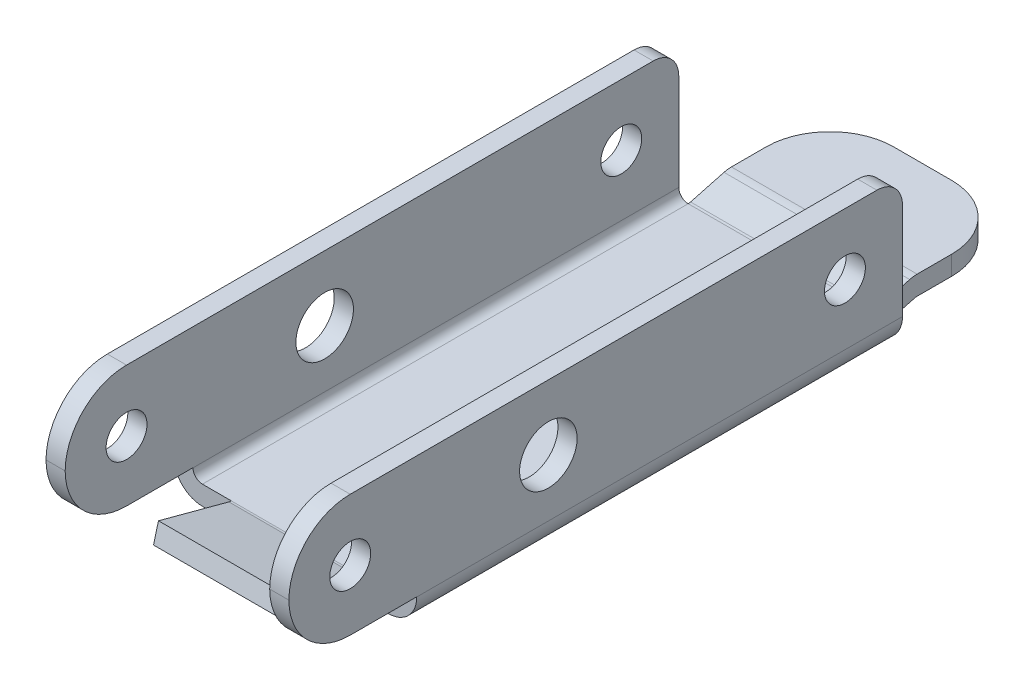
ISO-10303-21;
HEADER;
FILE_DESCRIPTION(('STEP AP214'),'2;1');
FILE_NAME('part.step','',(''),(''),'','','');
FILE_SCHEMA(('AUTOMOTIVE_DESIGN { 1 0 10303 214 1 1 1 1 }'));
ENDSEC;
DATA;
#1=APPLICATION_CONTEXT('core data for automotive mechanical design processes');
#2=APPLICATION_PROTOCOL_DEFINITION('international standard','automotive_design',2000,#1);
#3=PRODUCT_CONTEXT('',#1,'mechanical');
#4=PRODUCT('Part','Part','',(#3));
#5=PRODUCT_RELATED_PRODUCT_CATEGORY('part','',(#4));
#6=PRODUCT_DEFINITION_FORMATION('','',#4);
#7=PRODUCT_DEFINITION_CONTEXT('part definition',#1,'design');
#8=PRODUCT_DEFINITION('design','',#6,#7);
#9=PRODUCT_DEFINITION_SHAPE('','',#8);
#10=(LENGTH_UNIT() NAMED_UNIT(*) SI_UNIT(.MILLI.,.METRE.));
#11=(NAMED_UNIT(*) PLANE_ANGLE_UNIT() SI_UNIT($,.RADIAN.));
#12=(NAMED_UNIT(*) SI_UNIT($,.STERADIAN.) SOLID_ANGLE_UNIT());
#13=UNCERTAINTY_MEASURE_WITH_UNIT(LENGTH_MEASURE(1.E-05),#10,'distance_accuracy_value','');
#14=(GEOMETRIC_REPRESENTATION_CONTEXT(3) GLOBAL_UNCERTAINTY_ASSIGNED_CONTEXT((#13)) GLOBAL_UNIT_ASSIGNED_CONTEXT((#10,
#11,#12)) REPRESENTATION_CONTEXT('',''));
#15=CARTESIAN_POINT('',(0.,0.,0.));
#16=DIRECTION('',(0.,0.,1.));
#17=DIRECTION('',(1.,0.,0.));
#18=AXIS2_PLACEMENT_3D('',#15,#16,#17);
#19=CARTESIAN_POINT('',(0.,-0.698443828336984,-0.0936708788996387));
#20=DIRECTION('',(0.,-1.,0.));
#21=DIRECTION('',(0.,0.,-1.));
#22=AXIS2_PLACEMENT_3D('',#19,#20,#21);
#23=PLANE('',#22);
#24=DIRECTION('',(0.,0.,1.));
#25=VECTOR('',#24,1.);
#26=CARTESIAN_POINT('',(7.26339999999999,-0.698443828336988,-35.0884235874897));
#27=LINE('',#26,#25);
#28=CARTESIAN_POINT('',(7.2634,-0.698443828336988,-30.0884235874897));
#29=VERTEX_POINT('',#28);
#30=CARTESIAN_POINT('',(7.2634,-0.698443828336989,-27.3828775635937));
#31=VERTEX_POINT('',#30);
#32=EDGE_CURVE('E233',#29,#31,#27,.T.);
#33=ORIENTED_EDGE('',*,*,#32,.T.);
#34=DIRECTION('',(1.,0.,0.));
#35=VECTOR('',#34,1.);
#36=CARTESIAN_POINT('',(7.26339999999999,-0.69844382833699,-27.3828775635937));
#37=LINE('',#36,#35);
#38=CARTESIAN_POINT('',(-7.2634,-0.69844382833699,-27.3828775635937));
#39=VERTEX_POINT('',#38);
#40=EDGE_CURVE('E259',#31,#39,#37,.F.);
#41=ORIENTED_EDGE('',*,*,#40,.T.);
#42=DIRECTION('',(0.,0.,-1.));
#43=VECTOR('',#42,1.);
#44=CARTESIAN_POINT('',(-7.2634,-0.69844382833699,-27.2859023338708));
#45=LINE('',#44,#43);
#46=CARTESIAN_POINT('',(-7.2634,-0.69844382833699,-30.0884235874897));
#47=VERTEX_POINT('',#46);
#48=EDGE_CURVE('E249',#39,#47,#45,.T.);
#49=ORIENTED_EDGE('',*,*,#48,.T.);
#50=CARTESIAN_POINT('',(-2.2634,-0.69844382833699,-30.0884235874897));
#51=DIRECTION('',(0.,-1.,0.));
#52=DIRECTION('',(0.,0.,-1.));
#53=AXIS2_PLACEMENT_3D('',#50,#51,#52);
#54=CIRCLE('',#53,5.);
#55=CARTESIAN_POINT('',(-2.2634,-0.698443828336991,-35.0884235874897));
#56=VERTEX_POINT('',#55);
#57=EDGE_CURVE('E264',#56,#47,#54,.F.);
#58=ORIENTED_EDGE('',*,*,#57,.F.);
#59=DIRECTION('',(1.,0.,0.));
#60=VECTOR('',#59,1.);
#61=CARTESIAN_POINT('',(-7.2634,-0.698443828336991,-35.0884235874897));
#62=LINE('',#61,#60);
#63=CARTESIAN_POINT('',(2.26339999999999,-0.69844382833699,-35.0884235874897));
#64=VERTEX_POINT('',#63);
#65=EDGE_CURVE('E236',#56,#64,#62,.T.);
#66=ORIENTED_EDGE('',*,*,#65,.T.);
#67=CARTESIAN_POINT('',(2.2634,-0.698443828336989,-30.0884235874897));
#68=DIRECTION('',(0.,-1.,0.));
#69=DIRECTION('',(0.,0.,-1.));
#70=AXIS2_PLACEMENT_3D('',#67,#68,#69);
#71=CIRCLE('',#70,5.);
#72=EDGE_CURVE('E19',#29,#64,#71,.F.);
#73=ORIENTED_EDGE('',*,*,#72,.F.);
#74=EDGE_LOOP('',(#33,#41,#49,#58,#66,#73));
#75=FACE_BOUND('',#74,.T.);
#76=ADVANCED_FACE('F16',(#75),#23,.T.);
#77=CARTESIAN_POINT('',(2.2634,0.801556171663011,-30.0884235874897));
#78=DIRECTION('',(0.,-1.,0.));
#79=DIRECTION('',(0.,0.,-1.));
#80=AXIS2_PLACEMENT_3D('',#77,#78,#79);
#81=CYLINDRICAL_SURFACE('',#80,5.);
#82=ORIENTED_EDGE('',*,*,#72,.T.);
#83=DIRECTION('',(0.,1.,0.));
#84=VECTOR('',#83,1.);
#85=CARTESIAN_POINT('',(2.26339999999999,0.801556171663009,-35.0884235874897));
#86=LINE('',#85,#84);
#87=CARTESIAN_POINT('',(2.2634,0.80155617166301,-35.0884235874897));
#88=VERTEX_POINT('',#87);
#89=EDGE_CURVE('E422',#64,#88,#86,.T.);
#90=ORIENTED_EDGE('',*,*,#89,.T.);
#91=CARTESIAN_POINT('',(2.2634,0.801556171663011,-30.0884235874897));
#92=DIRECTION('',(0.,-1.,0.));
#93=DIRECTION('',(0.,0.,-1.));
#94=AXIS2_PLACEMENT_3D('',#91,#92,#93);
#95=CIRCLE('',#94,5.);
#96=CARTESIAN_POINT('',(7.26339999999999,0.801556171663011,-30.0884235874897));
#97=VERTEX_POINT('',#96);
#98=EDGE_CURVE('E253',#88,#97,#95,.T.);
#99=ORIENTED_EDGE('',*,*,#98,.T.);
#100=DIRECTION('',(0.,1.,0.));
#101=VECTOR('',#100,1.);
#102=CARTESIAN_POINT('',(7.2634,0.80155617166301,-30.0884235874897));
#103=LINE('',#102,#101);
#104=EDGE_CURVE('E241',#97,#29,#103,.F.);
#105=ORIENTED_EDGE('',*,*,#104,.T.);
#106=EDGE_LOOP('',(#82,#90,#99,#105));
#107=FACE_BOUND('',#106,.T.);
#108=ADVANCED_FACE('F252',(#107),#81,.T.);
#109=CARTESIAN_POINT('',(-2.2634,0.80155617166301,-30.0884235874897));
#110=DIRECTION('',(0.,-1.,0.));
#111=DIRECTION('',(0.,0.,-1.));
#112=AXIS2_PLACEMENT_3D('',#109,#110,#111);
#113=CYLINDRICAL_SURFACE('',#112,5.);
#114=ORIENTED_EDGE('',*,*,#57,.T.);
#115=DIRECTION('',(0.,-1.,0.));
#116=VECTOR('',#115,1.);
#117=CARTESIAN_POINT('',(-7.2634,0.80155617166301,-30.0884235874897));
#118=LINE('',#117,#116);
#119=CARTESIAN_POINT('',(-7.26339999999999,0.80155617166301,-30.0884235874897));
#120=VERTEX_POINT('',#119);
#121=EDGE_CURVE('E419',#47,#120,#118,.F.);
#122=ORIENTED_EDGE('',*,*,#121,.T.);
#123=CARTESIAN_POINT('',(-2.2634,0.80155617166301,-30.0884235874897));
#124=DIRECTION('',(0.,-1.,0.));
#125=DIRECTION('',(0.,0.,-1.));
#126=AXIS2_PLACEMENT_3D('',#123,#124,#125);
#127=CIRCLE('',#126,5.);
#128=CARTESIAN_POINT('',(-2.2634,0.80155617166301,-35.0884235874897));
#129=VERTEX_POINT('',#128);
#130=EDGE_CURVE('E400',#120,#129,#127,.T.);
#131=ORIENTED_EDGE('',*,*,#130,.T.);
#132=DIRECTION('',(0.,1.,0.));
#133=VECTOR('',#132,1.);
#134=CARTESIAN_POINT('',(-2.2634,0.801556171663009,-35.0884235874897));
#135=LINE('',#134,#133);
#136=EDGE_CURVE('E266',#129,#56,#135,.F.);
#137=ORIENTED_EDGE('',*,*,#136,.T.);
#138=EDGE_LOOP('',(#114,#122,#131,#137));
#139=FACE_BOUND('',#138,.T.);
#140=ADVANCED_FACE('F782',(#139),#113,.T.);
#141=CARTESIAN_POINT('',(-7.2634,0.801556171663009,-35.0884235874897));
#142=DIRECTION('',(0.,0.,1.));
#143=DIRECTION('',(1.,0.,0.));
#144=AXIS2_PLACEMENT_3D('',#141,#142,#143);
#145=PLANE('',#144);
#146=ORIENTED_EDGE('',*,*,#136,.F.);
#147=DIRECTION('',(1.,0.,0.));
#148=VECTOR('',#147,1.);
#149=CARTESIAN_POINT('',(0.,0.80155617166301,-35.0884235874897));
#150=LINE('',#149,#148);
#151=EDGE_CURVE('E403',#129,#88,#150,.T.);
#152=ORIENTED_EDGE('',*,*,#151,.T.);
#153=ORIENTED_EDGE('',*,*,#89,.F.);
#154=ORIENTED_EDGE('',*,*,#65,.F.);
#155=EDGE_LOOP('',(#146,#152,#153,#154));
#156=FACE_BOUND('',#155,.T.);
#157=ADVANCED_FACE('F789',(#156),#145,.F.);
#158=CARTESIAN_POINT('',(7.26339999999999,-1.43504382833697,-27.3828775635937));
#159=DIRECTION('',(1.,0.,0.));
#160=DIRECTION('',(0.,0.,-1.));
#161=AXIS2_PLACEMENT_3D('',#158,#159,#160);
#162=CYLINDRICAL_SURFACE('',#161,0.736599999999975);
#163=CARTESIAN_POINT('',(-7.26339999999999,-1.43504382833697,-27.3828775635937));
#164=DIRECTION('',(1.,0.,0.));
#165=DIRECTION('',(0.,0.,-1.));
#166=AXIS2_PLACEMENT_3D('',#163,#164,#165);
#167=CIRCLE('',#166,0.736599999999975);
#168=CARTESIAN_POINT('',(-7.2634,-0.72354286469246,-27.1922314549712));
#169=VERTEX_POINT('',#168);
#170=EDGE_CURVE('E260',#39,#169,#167,.T.);
#171=ORIENTED_EDGE('',*,*,#170,.F.);
#172=ORIENTED_EDGE('',*,*,#40,.F.);
#173=CARTESIAN_POINT('',(7.2634,-1.43504382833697,-27.3828775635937));
#174=DIRECTION('',(1.,0.,0.));
#175=DIRECTION('',(0.,0.,-1.));
#176=AXIS2_PLACEMENT_3D('',#173,#174,#175);
#177=CIRCLE('',#176,0.736599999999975);
#178=CARTESIAN_POINT('',(7.2634,-0.723542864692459,-27.1922314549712));
#179=VERTEX_POINT('',#178);
#180=EDGE_CURVE('E248',#31,#179,#177,.T.);
#181=ORIENTED_EDGE('',*,*,#180,.T.);
#182=DIRECTION('',(1.,0.,0.));
#183=VECTOR('',#182,1.);
#184=CARTESIAN_POINT('',(0.,-0.723542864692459,-27.1922314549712));
#185=LINE('',#184,#183);
#186=EDGE_CURVE('E399',#179,#169,#185,.F.);
#187=ORIENTED_EDGE('',*,*,#186,.T.);
#188=EDGE_LOOP('',(#171,#172,#181,#187));
#189=FACE_BOUND('',#188,.T.);
#190=ADVANCED_FACE('F797',(#189),#162,.F.);
#191=CARTESIAN_POINT('',(0.,0.801556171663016,-0.093670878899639));
#192=DIRECTION('',(0.,-1.,0.));
#193=DIRECTION('',(0.,0.,-1.));
#194=AXIS2_PLACEMENT_3D('',#191,#192,#193);
#195=PLANE('',#194);
#196=ORIENTED_EDGE('',*,*,#130,.F.);
#197=DIRECTION('',(0.,0.,-1.));
#198=VECTOR('',#197,1.);
#199=CARTESIAN_POINT('',(-7.26339999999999,0.801556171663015,-0.093670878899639));
#200=LINE('',#199,#198);
#201=CARTESIAN_POINT('',(-7.26339999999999,0.80155617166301,-27.3828775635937));
#202=VERTEX_POINT('',#201);
#203=EDGE_CURVE('E404',#202,#120,#200,.T.);
#204=ORIENTED_EDGE('',*,*,#203,.F.);
#205=DIRECTION('',(1.,0.,0.));
#206=VECTOR('',#205,1.);
#207=CARTESIAN_POINT('',(7.26339999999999,0.80155617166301,-27.3828775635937));
#208=LINE('',#207,#206);
#209=CARTESIAN_POINT('',(7.2634,0.801556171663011,-27.3828775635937));
#210=VERTEX_POINT('',#209);
#211=EDGE_CURVE('E257',#210,#202,#208,.F.);
#212=ORIENTED_EDGE('',*,*,#211,.F.);
#213=DIRECTION('',(0.,0.,-1.));
#214=VECTOR('',#213,1.);
#215=CARTESIAN_POINT('',(7.2634,0.801556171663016,-0.093670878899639));
#216=LINE('',#215,#214);
#217=EDGE_CURVE('E406',#97,#210,#216,.F.);
#218=ORIENTED_EDGE('',*,*,#217,.F.);
#219=ORIENTED_EDGE('',*,*,#98,.F.);
#220=ORIENTED_EDGE('',*,*,#151,.F.);
#221=EDGE_LOOP('',(#196,#204,#212,#218,#219,#220));
#222=FACE_BOUND('',#221,.T.);
#223=ADVANCED_FACE('F806',(#222),#195,.F.);
#224=CARTESIAN_POINT('',(0.,-4.94888873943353,1.42302597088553));
#225=DIRECTION('',(0.,0.96592582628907,-0.258819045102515));
#226=DIRECTION('',(0.,0.258819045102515,0.96592582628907));
#227=AXIS2_PLACEMENT_3D('',#224,#225,#226);
#228=PLANE('',#227);
#229=DIRECTION('',(0.,0.258819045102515,0.96592582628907));
#230=VECTOR('',#229,1.);
#231=CARTESIAN_POINT('',(5.00000000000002,-1.42378970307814,14.5788746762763));
#232=LINE('',#231,#230);
#233=CARTESIAN_POINT('',(5.00000000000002,-1.42378970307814,14.5788746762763));
#234=VERTEX_POINT('',#233);
#235=CARTESIAN_POINT('',(5.00000000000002,0.0529142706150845,20.0900089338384));
#236=VERTEX_POINT('',#235);
#237=EDGE_CURVE('E398',#234,#236,#232,.T.);
#238=ORIENTED_EDGE('',*,*,#237,.T.);
#239=DIRECTION('',(1.,0.,0.));
#240=VECTOR('',#239,1.);
#241=CARTESIAN_POINT('',(-5.00000000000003,0.0529142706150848,20.0900089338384));
#242=LINE('',#241,#240);
#243=CARTESIAN_POINT('',(-5.00000000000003,0.0529142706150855,20.0900089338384));
#244=VERTEX_POINT('',#243);
#245=EDGE_CURVE('E435',#236,#244,#242,.F.);
#246=ORIENTED_EDGE('',*,*,#245,.T.);
#247=DIRECTION('',(0.,-0.258819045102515,-0.96592582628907));
#248=VECTOR('',#247,1.);
#249=CARTESIAN_POINT('',(-5.00000000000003,0.0529142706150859,20.0900089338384));
#250=LINE('',#249,#248);
#251=CARTESIAN_POINT('',(-5.00000000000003,-1.42378970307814,14.5788746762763));
#252=VERTEX_POINT('',#251);
#253=EDGE_CURVE('E432',#244,#252,#250,.T.);
#254=ORIENTED_EDGE('',*,*,#253,.T.);
#255=DIRECTION('',(1.,0.,0.));
#256=VECTOR('',#255,1.);
#257=CARTESIAN_POINT('',(5.00000000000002,-1.42378970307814,14.5788746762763));
#258=LINE('',#257,#256);
#259=EDGE_CURVE('E483',#234,#252,#258,.F.);
#260=ORIENTED_EDGE('',*,*,#259,.F.);
#261=EDGE_LOOP('',(#238,#246,#254,#260));
#262=FACE_BOUND('',#261,.T.);
#263=ADVANCED_FACE('F651',(#262),#228,.F.);
#264=CARTESIAN_POINT('',(0.,-7.44888873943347,-2.0928989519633));
#265=DIRECTION('',(0.,0.96592582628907,0.258819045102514));
#266=DIRECTION('',(0.,-0.258819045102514,0.96592582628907));
#267=AXIS2_PLACEMENT_3D('',#264,#265,#266);
#268=PLANE('',#267);
#269=DIRECTION('',(0.,0.258819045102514,-0.96592582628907));
#270=VECTOR('',#269,1.);
#271=CARTESIAN_POINT('',(-7.2634,-1.42378970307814,-24.5788746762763));
#272=LINE('',#271,#270);
#273=CARTESIAN_POINT('',(-7.26339999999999,-1.42378970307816,-24.5788746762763));
#274=VERTEX_POINT('',#273);
#275=EDGE_CURVE('E457',#274,#169,#272,.T.);
#276=ORIENTED_EDGE('',*,*,#275,.T.);
#277=ORIENTED_EDGE('',*,*,#186,.F.);
#278=DIRECTION('',(0.,-0.258819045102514,0.96592582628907));
#279=VECTOR('',#278,1.);
#280=CARTESIAN_POINT('',(7.2634,-0.723542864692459,-27.1922314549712));
#281=LINE('',#280,#279);
#282=CARTESIAN_POINT('',(7.2634,-1.42378970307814,-24.5788746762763));
#283=VERTEX_POINT('',#282);
#284=EDGE_CURVE('E460',#179,#283,#281,.T.);
#285=ORIENTED_EDGE('',*,*,#284,.T.);
#286=DIRECTION('',(-1.,0.,0.));
#287=VECTOR('',#286,1.);
#288=CARTESIAN_POINT('',(-7.26339999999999,-1.42378970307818,-24.5788746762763));
#289=LINE('',#288,#287);
#290=EDGE_CURVE('E372',#274,#283,#289,.F.);
#291=ORIENTED_EDGE('',*,*,#290,.F.);
#292=EDGE_LOOP('',(#276,#277,#285,#291));
#293=FACE_BOUND('',#292,.T.);
#294=ADVANCED_FACE('F823',(#293),#268,.F.);
#295=CARTESIAN_POINT('',(-5.00000000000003,0.052914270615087,20.0900089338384));
#296=DIRECTION('',(0.,-0.258819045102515,-0.96592582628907));
#297=DIRECTION('',(0.,0.96592582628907,-0.258819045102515));
#298=AXIS2_PLACEMENT_3D('',#295,#296,#297);
#299=PLANE('',#298);
#300=DIRECTION('',(0.,0.96592582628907,-0.258819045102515));
#301=VECTOR('',#300,1.);
#302=CARTESIAN_POINT('',(-5.00000000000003,0.052914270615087,20.0900089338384));
#303=LINE('',#302,#301);
#304=CARTESIAN_POINT('',(-5.00000000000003,1.50180301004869,19.7017803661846));
#305=VERTEX_POINT('',#304);
#306=EDGE_CURVE('E438',#244,#305,#303,.T.);
#307=ORIENTED_EDGE('',*,*,#306,.F.);
#308=ORIENTED_EDGE('',*,*,#245,.F.);
#309=DIRECTION('',(0.,0.96592582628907,-0.258819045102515));
#310=VECTOR('',#309,1.);
#311=CARTESIAN_POINT('',(5.00000000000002,0.0529142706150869,20.0900089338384));
#312=LINE('',#311,#310);
#313=CARTESIAN_POINT('',(5.00000000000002,1.50180301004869,19.7017803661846));
#314=VERTEX_POINT('',#313);
#315=EDGE_CURVE('E439',#314,#236,#312,.F.);
#316=ORIENTED_EDGE('',*,*,#315,.F.);
#317=DIRECTION('',(1.,0.,0.));
#318=VECTOR('',#317,1.);
#319=CARTESIAN_POINT('',(0.,1.50180301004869,19.7017803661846));
#320=LINE('',#319,#318);
#321=EDGE_CURVE('E342',#305,#314,#320,.T.);
#322=ORIENTED_EDGE('',*,*,#321,.F.);
#323=EDGE_LOOP('',(#307,#308,#316,#322));
#324=FACE_BOUND('',#323,.T.);
#325=ADVANCED_FACE('F655',(#324),#299,.F.);
#326=CARTESIAN_POINT('',(-9.5,0.,0.));
#327=DIRECTION('',(1.,0.,0.));
#328=DIRECTION('',(0.,1.,0.));
#329=AXIS2_PLACEMENT_3D('',#326,#327,#328);
#330=PLANE('',#329);
#331=CARTESIAN_POINT('',(-9.50000000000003,8.29999999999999,-22.));
#332=DIRECTION('',(1.,0.,0.));
#333=DIRECTION('',(0.,1.,0.));
#334=AXIS2_PLACEMENT_3D('',#331,#332,#333);
#335=CIRCLE('',#334,2.);
#336=CARTESIAN_POINT('',(-9.50000000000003,8.29999999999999,-24.));
#337=VERTEX_POINT('',#336);
#338=CARTESIAN_POINT('',(-9.50000000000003,10.3,-22.));
#339=VERTEX_POINT('',#338);
#340=EDGE_CURVE('E379',#337,#339,#335,.T.);
#341=ORIENTED_EDGE('',*,*,#340,.F.);
#342=DIRECTION('',(0.,1.,0.));
#343=VECTOR('',#342,1.);
#344=CARTESIAN_POINT('',(-9.50000000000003,0.,-24.));
#345=LINE('',#344,#343);
#346=CARTESIAN_POINT('',(-9.50000000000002,0.736599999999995,-24.));
#347=VERTEX_POINT('',#346);
#348=EDGE_CURVE('E382',#337,#347,#345,.F.);
#349=ORIENTED_EDGE('',*,*,#348,.T.);
#350=DIRECTION('',(0.,0.,1.));
#351=VECTOR('',#350,1.);
#352=CARTESIAN_POINT('',(-9.5,0.736599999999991,24.));
#353=LINE('',#352,#351);
#354=CARTESIAN_POINT('',(-9.5,0.736599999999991,14.));
#355=VERTEX_POINT('',#354);
#356=EDGE_CURVE('E339',#355,#347,#353,.F.);
#357=ORIENTED_EDGE('',*,*,#356,.F.);
#358=DIRECTION('',(0.,1.,0.));
#359=VECTOR('',#358,1.);
#360=CARTESIAN_POINT('',(-9.5,0.,14.));
#361=LINE('',#360,#359);
#362=CARTESIAN_POINT('',(-9.50000000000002,0.75,14.));
#363=VERTEX_POINT('',#362);
#364=EDGE_CURVE('E395',#363,#355,#361,.F.);
#365=ORIENTED_EDGE('',*,*,#364,.F.);
#366=DIRECTION('',(0.,0.,1.));
#367=VECTOR('',#366,1.);
#368=CARTESIAN_POINT('',(-9.50000000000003,0.75,0.));
#369=LINE('',#368,#367);
#370=CARTESIAN_POINT('',(-9.50000000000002,0.75,19.2));
#371=VERTEX_POINT('',#370);
#372=EDGE_CURVE('E452',#363,#371,#369,.T.);
#373=ORIENTED_EDGE('',*,*,#372,.T.);
#374=CARTESIAN_POINT('',(-9.50000000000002,5.55,19.2));
#375=DIRECTION('',(1.,0.,0.));
#376=DIRECTION('',(0.,0.,-1.));
#377=AXIS2_PLACEMENT_3D('',#374,#375,#376);
#378=CIRCLE('',#377,4.8);
#379=CARTESIAN_POINT('',(-9.50000000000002,5.52500000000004,23.9999348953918));
#380=VERTEX_POINT('',#379);
#381=EDGE_CURVE('E373',#380,#371,#378,.T.);
#382=ORIENTED_EDGE('',*,*,#381,.F.);
#383=CARTESIAN_POINT('',(-9.50000000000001,5.49999999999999,19.2));
#384=DIRECTION('',(1.,0.,0.));
#385=DIRECTION('',(0.,1.,0.));
#386=AXIS2_PLACEMENT_3D('',#383,#384,#385);
#387=CIRCLE('',#386,4.8);
#388=CARTESIAN_POINT('',(-9.50000000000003,10.3,19.2));
#389=VERTEX_POINT('',#388);
#390=EDGE_CURVE('E376',#389,#380,#387,.T.);
#391=ORIENTED_EDGE('',*,*,#390,.F.);
#392=DIRECTION('',(0.,0.,1.));
#393=VECTOR('',#392,1.);
#394=CARTESIAN_POINT('',(-9.50000000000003,10.3,-24.));
#395=LINE('',#394,#393);
#396=EDGE_CURVE('E446',#389,#339,#395,.F.);
#397=ORIENTED_EDGE('',*,*,#396,.T.);
#398=EDGE_LOOP('',(#341,#349,#357,#365,#373,#382,#391,#397));
#399=FACE_BOUND('',#398,.T.);
#400=CARTESIAN_POINT('',(-9.50000000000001,5.50000000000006,19.2));
#401=DIRECTION('',(1.,0.,0.));
#402=DIRECTION('',(0.,1.,0.));
#403=AXIS2_PLACEMENT_3D('',#400,#401,#402);
#404=CIRCLE('',#403,1.6);
#405=CARTESIAN_POINT('',(-9.5,7.10000000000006,19.2));
#406=VERTEX_POINT('',#405);
#407=EDGE_CURVE('E383',#406,#406,#404,.T.);
#408=ORIENTED_EDGE('',*,*,#407,.T.);
#409=EDGE_LOOP('',(#408));
#410=FACE_BOUND('',#409,.T.);
#411=CARTESIAN_POINT('',(-9.50000000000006,5.50000000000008,-19.4999999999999));
#412=DIRECTION('',(1.,0.,0.));
#413=DIRECTION('',(0.,1.,0.));
#414=AXIS2_PLACEMENT_3D('',#411,#412,#413);
#415=CIRCLE('',#414,1.6);
#416=CARTESIAN_POINT('',(-9.50000000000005,7.10000000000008,-19.4999999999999));
#417=VERTEX_POINT('',#416);
#418=EDGE_CURVE('E386',#417,#417,#415,.T.);
#419=ORIENTED_EDGE('',*,*,#418,.T.);
#420=EDGE_LOOP('',(#419));
#421=FACE_BOUND('',#420,.T.);
#422=CARTESIAN_POINT('',(-9.50000000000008,5.21801948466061,3.70000000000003));
#423=DIRECTION('',(1.,0.,0.));
#424=DIRECTION('',(0.,1.,0.));
#425=AXIS2_PLACEMENT_3D('',#422,#423,#424);
#426=CIRCLE('',#425,2.25);
#427=CARTESIAN_POINT('',(-9.50000000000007,7.46801948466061,3.70000000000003));
#428=VERTEX_POINT('',#427);
#429=EDGE_CURVE('E389',#428,#428,#426,.T.);
#430=ORIENTED_EDGE('',*,*,#429,.T.);
#431=EDGE_LOOP('',(#430));
#432=FACE_BOUND('',#431,.T.);
#433=ADVANCED_FACE('F707',(#399,#410,#421,#432),#330,.F.);
#434=CARTESIAN_POINT('',(-9.50000000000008,5.21801948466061,3.70000000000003));
#435=DIRECTION('',(1.,0.,0.));
#436=DIRECTION('',(0.,1.,0.));
#437=AXIS2_PLACEMENT_3D('',#434,#435,#436);
#438=CYLINDRICAL_SURFACE('',#437,2.25);
#439=CARTESIAN_POINT('',(-8.00000000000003,5.21801948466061,3.70000000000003));
#440=DIRECTION('',(1.,0.,0.));
#441=DIRECTION('',(0.,1.,0.));
#442=AXIS2_PLACEMENT_3D('',#439,#440,#441);
#443=CIRCLE('',#442,2.25);
#444=CARTESIAN_POINT('',(-8.00000000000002,7.46801948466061,3.70000000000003));
#445=VERTEX_POINT('',#444);
#446=EDGE_CURVE('E333',#445,#445,#443,.F.);
#447=ORIENTED_EDGE('',*,*,#446,.F.);
#448=EDGE_LOOP('',(#447));
#449=FACE_BOUND('',#448,.T.);
#450=ORIENTED_EDGE('',*,*,#429,.F.);
#451=EDGE_LOOP('',(#450));
#452=FACE_BOUND('',#451,.T.);
#453=ADVANCED_FACE('F846',(#449,#452),#438,.F.);
#454=CARTESIAN_POINT('',(-9.50000000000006,5.50000000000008,-19.4999999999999));
#455=DIRECTION('',(1.,0.,0.));
#456=DIRECTION('',(0.,1.,0.));
#457=AXIS2_PLACEMENT_3D('',#454,#455,#456);
#458=CYLINDRICAL_SURFACE('',#457,1.6);
#459=CARTESIAN_POINT('',(-8.00000000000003,5.50000000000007,-19.4999999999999));
#460=DIRECTION('',(1.,0.,0.));
#461=DIRECTION('',(0.,1.,0.));
#462=AXIS2_PLACEMENT_3D('',#459,#460,#461);
#463=CIRCLE('',#462,1.6);
#464=CARTESIAN_POINT('',(-8.00000000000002,7.10000000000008,-19.4999999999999));
#465=VERTEX_POINT('',#464);
#466=EDGE_CURVE('E330',#465,#465,#463,.F.);
#467=ORIENTED_EDGE('',*,*,#466,.F.);
#468=EDGE_LOOP('',(#467));
#469=FACE_BOUND('',#468,.T.);
#470=ORIENTED_EDGE('',*,*,#418,.F.);
#471=EDGE_LOOP('',(#470));
#472=FACE_BOUND('',#471,.T.);
#473=ADVANCED_FACE('F854',(#469,#472),#458,.F.);
#474=CARTESIAN_POINT('',(-14.0254833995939,5.50000000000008,19.2));
#475=DIRECTION('',(1.,0.,0.));
#476=DIRECTION('',(0.,1.,0.));
#477=AXIS2_PLACEMENT_3D('',#474,#475,#476);
#478=CYLINDRICAL_SURFACE('',#477,1.6);
#479=CARTESIAN_POINT('',(-8.00000000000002,5.50000000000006,19.2));
#480=DIRECTION('',(1.,0.,0.));
#481=DIRECTION('',(0.,1.,0.));
#482=AXIS2_PLACEMENT_3D('',#479,#480,#481);
#483=CIRCLE('',#482,1.6);
#484=CARTESIAN_POINT('',(-8.00000000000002,7.10000000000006,19.2));
#485=VERTEX_POINT('',#484);
#486=EDGE_CURVE('E327',#485,#485,#483,.F.);
#487=ORIENTED_EDGE('',*,*,#486,.F.);
#488=EDGE_LOOP('',(#487));
#489=FACE_BOUND('',#488,.T.);
#490=ORIENTED_EDGE('',*,*,#407,.F.);
#491=EDGE_LOOP('',(#490));
#492=FACE_BOUND('',#491,.T.);
#493=ADVANCED_FACE('F863',(#489,#492),#478,.F.);
#494=CARTESIAN_POINT('',(-9.5,0.,-24.));
#495=DIRECTION('',(0.,0.,1.));
#496=DIRECTION('',(1.,0.,0.));
#497=AXIS2_PLACEMENT_3D('',#494,#495,#496);
#498=PLANE('',#497);
#499=DIRECTION('',(1.,0.,0.));
#500=VECTOR('',#499,1.);
#501=CARTESIAN_POINT('',(-9.50000000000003,8.29999999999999,-24.));
#502=LINE('',#501,#500);
#503=CARTESIAN_POINT('',(-8.00000000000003,8.3,-24.));
#504=VERTEX_POINT('',#503);
#505=EDGE_CURVE('E381',#504,#337,#502,.F.);
#506=ORIENTED_EDGE('',*,*,#505,.F.);
#507=DIRECTION('',(0.,1.,0.));
#508=VECTOR('',#507,1.);
#509=CARTESIAN_POINT('',(-8.,0.,-24.));
#510=LINE('',#509,#508);
#511=CARTESIAN_POINT('',(-8.,0.736599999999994,-24.));
#512=VERTEX_POINT('',#511);
#513=EDGE_CURVE('E326',#512,#504,#510,.T.);
#514=ORIENTED_EDGE('',*,*,#513,.F.);
#515=CARTESIAN_POINT('',(-7.2634,0.736599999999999,-24.));
#516=DIRECTION('',(0.,0.,1.));
#517=DIRECTION('',(1.,0.,0.));
#518=AXIS2_PLACEMENT_3D('',#515,#516,#517);
#519=CIRCLE('',#518,0.736600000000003);
#520=CARTESIAN_POINT('',(-7.2634,0.,-24.));
#521=VERTEX_POINT('',#520);
#522=EDGE_CURVE('E393',#512,#521,#519,.T.);
#523=ORIENTED_EDGE('',*,*,#522,.T.);
#524=DIRECTION('',(0.,1.,0.));
#525=VECTOR('',#524,1.);
#526=CARTESIAN_POINT('',(-7.2634,0.736599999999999,-24.));
#527=LINE('',#526,#525);
#528=CARTESIAN_POINT('',(-7.2634,-1.50000000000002,-24.));
#529=VERTEX_POINT('',#528);
#530=EDGE_CURVE('E392',#521,#529,#527,.F.);
#531=ORIENTED_EDGE('',*,*,#530,.T.);
#532=CARTESIAN_POINT('',(-7.2634,0.736599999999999,-24.));
#533=DIRECTION('',(0.,0.,1.));
#534=DIRECTION('',(1.,0.,0.));
#535=AXIS2_PLACEMENT_3D('',#532,#533,#534);
#536=CIRCLE('',#535,2.2366);
#537=EDGE_CURVE('E336',#347,#529,#536,.T.);
#538=ORIENTED_EDGE('',*,*,#537,.F.);
#539=ORIENTED_EDGE('',*,*,#348,.F.);
#540=EDGE_LOOP('',(#506,#514,#523,#531,#538,#539));
#541=FACE_BOUND('',#540,.T.);
#542=ADVANCED_FACE('F700',(#541),#498,.F.);
#543=CARTESIAN_POINT('',(-9.50000000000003,8.29999999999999,-22.));
#544=DIRECTION('',(1.,0.,0.));
#545=DIRECTION('',(0.,1.,0.));
#546=AXIS2_PLACEMENT_3D('',#543,#544,#545);
#547=CYLINDRICAL_SURFACE('',#546,2.);
#548=CARTESIAN_POINT('',(-8.00000000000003,8.3,-22.));
#549=DIRECTION('',(1.,0.,0.));
#550=DIRECTION('',(0.,1.,0.));
#551=AXIS2_PLACEMENT_3D('',#548,#549,#550);
#552=CIRCLE('',#551,2.);
#553=CARTESIAN_POINT('',(-8.00000000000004,10.3,-22.));
#554=VERTEX_POINT('',#553);
#555=EDGE_CURVE('E324',#504,#554,#552,.T.);
#556=ORIENTED_EDGE('',*,*,#555,.F.);
#557=ORIENTED_EDGE('',*,*,#505,.T.);
#558=ORIENTED_EDGE('',*,*,#340,.T.);
#559=DIRECTION('',(1.,0.,0.));
#560=VECTOR('',#559,1.);
#561=CARTESIAN_POINT('',(-9.50000000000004,10.3,-22.));
#562=LINE('',#561,#560);
#563=EDGE_CURVE('E449',#339,#554,#562,.T.);
#564=ORIENTED_EDGE('',*,*,#563,.T.);
#565=EDGE_LOOP('',(#556,#557,#558,#564));
#566=FACE_BOUND('',#565,.T.);
#567=ADVANCED_FACE('F711',(#566),#547,.T.);
#568=CARTESIAN_POINT('',(-9.50000000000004,10.3,-24.));
#569=DIRECTION('',(0.,-1.,0.));
#570=DIRECTION('',(1.,0.,0.));
#571=AXIS2_PLACEMENT_3D('',#568,#569,#570);
#572=PLANE('',#571);
#573=ORIENTED_EDGE('',*,*,#563,.F.);
#574=ORIENTED_EDGE('',*,*,#396,.F.);
#575=DIRECTION('',(1.,0.,0.));
#576=VECTOR('',#575,1.);
#577=CARTESIAN_POINT('',(-9.50000000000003,10.3,19.2));
#578=LINE('',#577,#576);
#579=CARTESIAN_POINT('',(-8.00000000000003,10.3,19.2));
#580=VERTEX_POINT('',#579);
#581=EDGE_CURVE('E378',#580,#389,#578,.F.);
#582=ORIENTED_EDGE('',*,*,#581,.F.);
#583=DIRECTION('',(0.,0.,1.));
#584=VECTOR('',#583,1.);
#585=CARTESIAN_POINT('',(-8.00000000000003,10.3,0.));
#586=LINE('',#585,#584);
#587=EDGE_CURVE('E323',#554,#580,#586,.T.);
#588=ORIENTED_EDGE('',*,*,#587,.F.);
#589=EDGE_LOOP('',(#573,#574,#582,#588));
#590=FACE_BOUND('',#589,.T.);
#591=ADVANCED_FACE('F887',(#590),#572,.F.);
#592=CARTESIAN_POINT('',(-9.50000000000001,5.49999999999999,19.2));
#593=DIRECTION('',(1.,0.,0.));
#594=DIRECTION('',(0.,1.,0.));
#595=AXIS2_PLACEMENT_3D('',#592,#593,#594);
#596=CYLINDRICAL_SURFACE('',#595,4.8);
#597=DIRECTION('',(1.,0.,0.));
#598=VECTOR('',#597,1.);
#599=CARTESIAN_POINT('',(-9.50000000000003,5.525,23.9999348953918));
#600=LINE('',#599,#598);
#601=CARTESIAN_POINT('',(-8.00000000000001,5.52500000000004,23.9999348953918));
#602=VERTEX_POINT('',#601);
#603=EDGE_CURVE('E375',#602,#380,#600,.F.);
#604=ORIENTED_EDGE('',*,*,#603,.F.);
#605=CARTESIAN_POINT('',(-8.00000000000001,5.5,19.2));
#606=DIRECTION('',(1.,0.,0.));
#607=DIRECTION('',(0.,1.,0.));
#608=AXIS2_PLACEMENT_3D('',#605,#606,#607);
#609=CIRCLE('',#608,4.8);
#610=EDGE_CURVE('E321',#580,#602,#609,.T.);
#611=ORIENTED_EDGE('',*,*,#610,.F.);
#612=ORIENTED_EDGE('',*,*,#581,.T.);
#613=ORIENTED_EDGE('',*,*,#390,.T.);
#614=EDGE_LOOP('',(#604,#611,#612,#613));
#615=FACE_BOUND('',#614,.T.);
#616=ADVANCED_FACE('F895',(#615),#596,.T.);
#617=CARTESIAN_POINT('',(-9.50000000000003,5.55,19.2));
#618=DIRECTION('',(1.,0.,0.));
#619=DIRECTION('',(0.,0.,-1.));
#620=AXIS2_PLACEMENT_3D('',#617,#618,#619);
#621=CYLINDRICAL_SURFACE('',#620,4.8);
#622=CARTESIAN_POINT('',(-8.,5.55,19.2));
#623=DIRECTION('',(1.,0.,0.));
#624=DIRECTION('',(0.,0.,-1.));
#625=AXIS2_PLACEMENT_3D('',#622,#623,#624);
#626=CIRCLE('',#625,4.8);
#627=CARTESIAN_POINT('',(-8.,0.75,19.2));
#628=VERTEX_POINT('',#627);
#629=EDGE_CURVE('E318',#602,#628,#626,.T.);
#630=ORIENTED_EDGE('',*,*,#629,.F.);
#631=ORIENTED_EDGE('',*,*,#603,.T.);
#632=ORIENTED_EDGE('',*,*,#381,.T.);
#633=DIRECTION('',(1.,0.,0.));
#634=VECTOR('',#633,1.);
#635=CARTESIAN_POINT('',(0.,0.75,19.2));
#636=LINE('',#635,#634);
#637=EDGE_CURVE('E455',#371,#628,#636,.T.);
#638=ORIENTED_EDGE('',*,*,#637,.T.);
#639=EDGE_LOOP('',(#630,#631,#632,#638));
#640=FACE_BOUND('',#639,.T.);
#641=ADVANCED_FACE('F904',(#640),#621,.T.);
#642=CARTESIAN_POINT('',(0.,0.75,0.));
#643=DIRECTION('',(0.,1.,0.));
#644=DIRECTION('',(0.,0.,1.));
#645=AXIS2_PLACEMENT_3D('',#642,#643,#644);
#646=PLANE('',#645);
#647=ORIENTED_EDGE('',*,*,#637,.F.);
#648=ORIENTED_EDGE('',*,*,#372,.F.);
#649=DIRECTION('',(1.,0.,0.));
#650=VECTOR('',#649,1.);
#651=CARTESIAN_POINT('',(0.,0.75,14.));
#652=LINE('',#651,#650);
#653=CARTESIAN_POINT('',(-8.,0.75,14.));
#654=VERTEX_POINT('',#653);
#655=EDGE_CURVE('E456',#654,#363,#652,.F.);
#656=ORIENTED_EDGE('',*,*,#655,.F.);
#657=DIRECTION('',(0.,0.,1.));
#658=VECTOR('',#657,1.);
#659=CARTESIAN_POINT('',(-8.,0.75,0.));
#660=LINE('',#659,#658);
#661=EDGE_CURVE('E320',#628,#654,#660,.F.);
#662=ORIENTED_EDGE('',*,*,#661,.F.);
#663=EDGE_LOOP('',(#647,#648,#656,#662));
#664=FACE_BOUND('',#663,.T.);
#665=ADVANCED_FACE('F913',(#664),#646,.F.);
#666=CARTESIAN_POINT('',(-7.2634,-0.723542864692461,-27.1922314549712));
#667=DIRECTION('',(1.,0.,0.));
#668=DIRECTION('',(0.,0.,-1.));
#669=AXIS2_PLACEMENT_3D('',#666,#667,#668);
#670=PLANE('',#669);
#671=DIRECTION('',(0.,-0.258819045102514,0.96592582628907));
#672=VECTOR('',#671,1.);
#673=CARTESIAN_POINT('',(-7.2634,-5.99999999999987,-1.70467038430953));
#674=LINE('',#673,#672);
#675=CARTESIAN_POINT('',(-7.2634,0.725345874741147,-26.8040028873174));
#676=VERTEX_POINT('',#675);
#677=CARTESIAN_POINT('',(-7.2634,0.0250990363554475,-24.1906461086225));
#678=VERTEX_POINT('',#677);
#679=EDGE_CURVE('E461',#676,#678,#674,.T.);
#680=ORIENTED_EDGE('',*,*,#679,.F.);
#681=CARTESIAN_POINT('',(-7.26339999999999,-1.43504382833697,-27.3828775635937));
#682=DIRECTION('',(1.,0.,0.));
#683=DIRECTION('',(0.,0.,-1.));
#684=AXIS2_PLACEMENT_3D('',#681,#682,#683);
#685=CIRCLE('',#684,2.23659999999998);
#686=EDGE_CURVE('E417',#676,#202,#685,.F.);
#687=ORIENTED_EDGE('',*,*,#686,.T.);
#688=ORIENTED_EDGE('',*,*,#203,.T.);
#689=ORIENTED_EDGE('',*,*,#121,.F.);
#690=ORIENTED_EDGE('',*,*,#48,.F.);
#691=ORIENTED_EDGE('',*,*,#170,.T.);
#692=ORIENTED_EDGE('',*,*,#275,.F.);
#693=CARTESIAN_POINT('',(-7.2634,0.736599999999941,-24.));
#694=DIRECTION('',(-1.,0.,0.));
#695=DIRECTION('',(0.,-1.,0.));
#696=AXIS2_PLACEMENT_3D('',#693,#694,#695);
#697=CIRCLE('',#696,2.23659999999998);
#698=EDGE_CURVE('E414',#529,#274,#697,.F.);
#699=ORIENTED_EDGE('',*,*,#698,.F.);
#700=ORIENTED_EDGE('',*,*,#530,.F.);
#701=CARTESIAN_POINT('',(-7.2634,0.736599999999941,-24.));
#702=DIRECTION('',(-1.,0.,0.));
#703=DIRECTION('',(0.,-1.,0.));
#704=AXIS2_PLACEMENT_3D('',#701,#702,#703);
#705=CIRCLE('',#704,0.73659999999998);
#706=EDGE_CURVE('E411',#678,#521,#705,.T.);
#707=ORIENTED_EDGE('',*,*,#706,.F.);
#708=EDGE_LOOP('',(#680,#687,#688,#689,#690,#691,#692,#699,#700,#707));
#709=FACE_BOUND('',#708,.T.);
#710=ADVANCED_FACE('F697',(#709),#670,.F.);
#711=CARTESIAN_POINT('',(7.2634,-1.44888873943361,-24.4852037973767));
#712=DIRECTION('',(-1.,0.,0.));
#713=DIRECTION('',(0.,0.,1.));
#714=AXIS2_PLACEMENT_3D('',#711,#712,#713);
#715=PLANE('',#714);
#716=ORIENTED_EDGE('',*,*,#284,.F.);
#717=ORIENTED_EDGE('',*,*,#180,.F.);
#718=ORIENTED_EDGE('',*,*,#32,.F.);
#719=ORIENTED_EDGE('',*,*,#104,.F.);
#720=ORIENTED_EDGE('',*,*,#217,.T.);
#721=CARTESIAN_POINT('',(7.2634,-1.43504382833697,-27.3828775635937));
#722=DIRECTION('',(1.,0.,0.));
#723=DIRECTION('',(0.,0.,-1.));
#724=AXIS2_PLACEMENT_3D('',#721,#722,#723);
#725=CIRCLE('',#724,2.23659999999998);
#726=CARTESIAN_POINT('',(7.2634,0.725345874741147,-26.8040028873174));
#727=VERTEX_POINT('',#726);
#728=EDGE_CURVE('E408',#727,#210,#725,.F.);
#729=ORIENTED_EDGE('',*,*,#728,.F.);
#730=DIRECTION('',(0.,-0.258819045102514,0.96592582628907));
#731=VECTOR('',#730,1.);
#732=CARTESIAN_POINT('',(7.2634,-5.99999999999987,-1.70467038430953));
#733=LINE('',#732,#731);
#734=CARTESIAN_POINT('',(7.2634,0.0250990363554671,-24.1906461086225));
#735=VERTEX_POINT('',#734);
#736=EDGE_CURVE('E464',#735,#727,#733,.F.);
#737=ORIENTED_EDGE('',*,*,#736,.F.);
#738=CARTESIAN_POINT('',(7.2634,0.736599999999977,-24.));
#739=DIRECTION('',(-1.,0.,0.));
#740=DIRECTION('',(0.,-1.,0.));
#741=AXIS2_PLACEMENT_3D('',#738,#739,#740);
#742=CIRCLE('',#741,0.73659999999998);
#743=CARTESIAN_POINT('',(7.2634,0.,-24.));
#744=VERTEX_POINT('',#743);
#745=EDGE_CURVE('E396',#735,#744,#742,.T.);
#746=ORIENTED_EDGE('',*,*,#745,.T.);
#747=DIRECTION('',(0.,1.,0.));
#748=VECTOR('',#747,1.);
#749=CARTESIAN_POINT('',(7.2634,0.7366,-24.));
#750=LINE('',#749,#748);
#751=CARTESIAN_POINT('',(7.2634,-1.5,-24.));
#752=VERTEX_POINT('',#751);
#753=EDGE_CURVE('E347',#744,#752,#750,.F.);
#754=ORIENTED_EDGE('',*,*,#753,.T.);
#755=CARTESIAN_POINT('',(7.2634,0.736599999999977,-24.));
#756=DIRECTION('',(-1.,0.,0.));
#757=DIRECTION('',(0.,-1.,0.));
#758=AXIS2_PLACEMENT_3D('',#755,#756,#757);
#759=CIRCLE('',#758,2.23659999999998);
#760=EDGE_CURVE('E370',#283,#752,#759,.T.);
#761=ORIENTED_EDGE('',*,*,#760,.F.);
#762=EDGE_LOOP('',(#716,#717,#718,#719,#720,#729,#737,#746,#754,#761));
#763=FACE_BOUND('',#762,.T.);
#764=ADVANCED_FACE('F244',(#763),#715,.F.);
#765=CARTESIAN_POINT('',(7.26339999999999,-1.43504382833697,-27.3828775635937));
#766=DIRECTION('',(1.,0.,0.));
#767=DIRECTION('',(0.,0.,-1.));
#768=AXIS2_PLACEMENT_3D('',#765,#766,#767);
#769=CYLINDRICAL_SURFACE('',#768,2.23659999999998);
#770=ORIENTED_EDGE('',*,*,#211,.T.);
#771=ORIENTED_EDGE('',*,*,#686,.F.);
#772=DIRECTION('',(1.,0.,0.));
#773=VECTOR('',#772,1.);
#774=CARTESIAN_POINT('',(0.,0.725345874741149,-26.8040028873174));
#775=LINE('',#774,#773);
#776=EDGE_CURVE('E317',#727,#676,#775,.F.);
#777=ORIENTED_EDGE('',*,*,#776,.F.);
#778=ORIENTED_EDGE('',*,*,#728,.T.);
#779=EDGE_LOOP('',(#770,#771,#777,#778));
#780=FACE_BOUND('',#779,.T.);
#781=ADVANCED_FACE('F937',(#780),#769,.T.);
#782=CARTESIAN_POINT('',(-9.50000000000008,5.21801948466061,3.70000000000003));
#783=DIRECTION('',(1.,0.,0.));
#784=DIRECTION('',(0.,1.,0.));
#785=AXIS2_PLACEMENT_3D('',#782,#783,#784);
#786=CYLINDRICAL_SURFACE('',#785,2.25);
#787=CARTESIAN_POINT('',(8.00000000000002,5.21801948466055,3.70000000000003));
#788=DIRECTION('',(1.,0.,0.));
#789=DIRECTION('',(0.,1.,0.));
#790=AXIS2_PLACEMENT_3D('',#787,#788,#789);
#791=CIRCLE('',#790,2.25);
#792=CARTESIAN_POINT('',(8.00000000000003,7.46801948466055,3.70000000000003));
#793=VERTEX_POINT('',#792);
#794=EDGE_CURVE('E314',#793,#793,#791,.T.);
#795=ORIENTED_EDGE('',*,*,#794,.F.);
#796=EDGE_LOOP('',(#795));
#797=FACE_BOUND('',#796,.T.);
#798=CARTESIAN_POINT('',(9.50000000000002,5.21801948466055,3.70000000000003));
#799=DIRECTION('',(1.,0.,0.));
#800=DIRECTION('',(0.,1.,0.));
#801=AXIS2_PLACEMENT_3D('',#798,#799,#800);
#802=CIRCLE('',#801,2.25);
#803=CARTESIAN_POINT('',(9.50000000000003,7.46801948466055,3.70000000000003));
#804=VERTEX_POINT('',#803);
#805=EDGE_CURVE('E367',#804,#804,#802,.T.);
#806=ORIENTED_EDGE('',*,*,#805,.T.);
#807=EDGE_LOOP('',(#806));
#808=FACE_BOUND('',#807,.T.);
#809=ADVANCED_FACE('F945',(#797,#808),#786,.F.);
#810=CARTESIAN_POINT('',(-9.50000000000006,5.50000000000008,-19.4999999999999));
#811=DIRECTION('',(1.,0.,0.));
#812=DIRECTION('',(0.,1.,0.));
#813=AXIS2_PLACEMENT_3D('',#810,#811,#812);
#814=CYLINDRICAL_SURFACE('',#813,1.6);
#815=CARTESIAN_POINT('',(8.00000000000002,5.50000000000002,-19.4999999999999));
#816=DIRECTION('',(1.,0.,0.));
#817=DIRECTION('',(0.,1.,0.));
#818=AXIS2_PLACEMENT_3D('',#815,#816,#817);
#819=CIRCLE('',#818,1.6);
#820=CARTESIAN_POINT('',(8.00000000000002,7.10000000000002,-19.4999999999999));
#821=VERTEX_POINT('',#820);
#822=EDGE_CURVE('E311',#821,#821,#819,.T.);
#823=ORIENTED_EDGE('',*,*,#822,.F.);
#824=EDGE_LOOP('',(#823));
#825=FACE_BOUND('',#824,.T.);
#826=CARTESIAN_POINT('',(9.50000000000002,5.50000000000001,-19.4999999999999));
#827=DIRECTION('',(1.,0.,0.));
#828=DIRECTION('',(0.,1.,0.));
#829=AXIS2_PLACEMENT_3D('',#826,#827,#828);
#830=CIRCLE('',#829,1.6);
#831=CARTESIAN_POINT('',(9.50000000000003,7.10000000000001,-19.4999999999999));
#832=VERTEX_POINT('',#831);
#833=EDGE_CURVE('E364',#832,#832,#830,.T.);
#834=ORIENTED_EDGE('',*,*,#833,.T.);
#835=EDGE_LOOP('',(#834));
#836=FACE_BOUND('',#835,.T.);
#837=ADVANCED_FACE('F954',(#825,#836),#814,.F.);
#838=CARTESIAN_POINT('',(-14.0254833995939,5.50000000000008,19.2));
#839=DIRECTION('',(1.,0.,0.));
#840=DIRECTION('',(0.,1.,0.));
#841=AXIS2_PLACEMENT_3D('',#838,#839,#840);
#842=CYLINDRICAL_SURFACE('',#841,1.6);
#843=CARTESIAN_POINT('',(8.00000000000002,5.5,19.2));
#844=DIRECTION('',(1.,0.,0.));
#845=DIRECTION('',(0.,1.,0.));
#846=AXIS2_PLACEMENT_3D('',#843,#844,#845);
#847=CIRCLE('',#846,1.6);
#848=CARTESIAN_POINT('',(8.00000000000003,7.1,19.2));
#849=VERTEX_POINT('',#848);
#850=EDGE_CURVE('E308',#849,#849,#847,.T.);
#851=ORIENTED_EDGE('',*,*,#850,.F.);
#852=EDGE_LOOP('',(#851));
#853=FACE_BOUND('',#852,.T.);
#854=CARTESIAN_POINT('',(9.50000000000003,5.49999999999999,19.2));
#855=DIRECTION('',(1.,0.,0.));
#856=DIRECTION('',(0.,1.,0.));
#857=AXIS2_PLACEMENT_3D('',#854,#855,#856);
#858=CIRCLE('',#857,1.6);
#859=CARTESIAN_POINT('',(9.50000000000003,7.1,19.2));
#860=VERTEX_POINT('',#859);
#861=EDGE_CURVE('E360',#860,#860,#858,.T.);
#862=ORIENTED_EDGE('',*,*,#861,.T.);
#863=EDGE_LOOP('',(#862));
#864=FACE_BOUND('',#863,.T.);
#865=ADVANCED_FACE('F963',(#853,#864),#842,.F.);
#866=CARTESIAN_POINT('',(9.50000000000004,10.3,24.));
#867=DIRECTION('',(0.,-1.,0.));
#868=DIRECTION('',(1.,0.,0.));
#869=AXIS2_PLACEMENT_3D('',#866,#867,#868);
#870=PLANE('',#869);
#871=DIRECTION('',(-1.,0.,0.));
#872=VECTOR('',#871,1.);
#873=CARTESIAN_POINT('',(9.50000000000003,10.3,-22.));
#874=LINE('',#873,#872);
#875=CARTESIAN_POINT('',(8.00000000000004,10.3,-22.));
#876=VERTEX_POINT('',#875);
#877=CARTESIAN_POINT('',(9.50000000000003,10.3,-22.));
#878=VERTEX_POINT('',#877);
#879=EDGE_CURVE('E516',#876,#878,#874,.F.);
#880=ORIENTED_EDGE('',*,*,#879,.F.);
#881=DIRECTION('',(0.,0.,1.));
#882=VECTOR('',#881,1.);
#883=CARTESIAN_POINT('',(8.00000000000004,10.3,0.));
#884=LINE('',#883,#882);
#885=CARTESIAN_POINT('',(8.00000000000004,10.3,19.2));
#886=VERTEX_POINT('',#885);
#887=EDGE_CURVE('E307',#886,#876,#884,.F.);
#888=ORIENTED_EDGE('',*,*,#887,.F.);
#889=DIRECTION('',(-1.,0.,0.));
#890=VECTOR('',#889,1.);
#891=CARTESIAN_POINT('',(9.50000000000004,10.3,19.2));
#892=LINE('',#891,#890);
#893=CARTESIAN_POINT('',(9.50000000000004,10.3,19.2));
#894=VERTEX_POINT('',#893);
#895=EDGE_CURVE('E528',#894,#886,#892,.T.);
#896=ORIENTED_EDGE('',*,*,#895,.F.);
#897=DIRECTION('',(0.,0.,1.));
#898=VECTOR('',#897,1.);
#899=CARTESIAN_POINT('',(9.50000000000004,10.3,0.));
#900=LINE('',#899,#898);
#901=EDGE_CURVE('E352',#894,#878,#900,.F.);
#902=ORIENTED_EDGE('',*,*,#901,.T.);
#903=EDGE_LOOP('',(#880,#888,#896,#902));
#904=FACE_BOUND('',#903,.T.);
#905=ADVANCED_FACE('F972',(#904),#870,.F.);
#906=CARTESIAN_POINT('',(9.50000000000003,8.29999999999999,-22.));
#907=DIRECTION('',(-1.,0.,0.));
#908=DIRECTION('',(0.,-1.,0.));
#909=AXIS2_PLACEMENT_3D('',#906,#907,#908);
#910=CYLINDRICAL_SURFACE('',#909,2.);
#911=CARTESIAN_POINT('',(8.00000000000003,8.3,-22.));
#912=DIRECTION('',(-1.,0.,0.));
#913=DIRECTION('',(0.,-1.,0.));
#914=AXIS2_PLACEMENT_3D('',#911,#912,#913);
#915=CIRCLE('',#914,2.);
#916=CARTESIAN_POINT('',(8.00000000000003,8.3,-24.));
#917=VERTEX_POINT('',#916);
#918=EDGE_CURVE('E304',#876,#917,#915,.T.);
#919=ORIENTED_EDGE('',*,*,#918,.F.);
#920=ORIENTED_EDGE('',*,*,#879,.T.);
#921=CARTESIAN_POINT('',(9.50000000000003,8.29999999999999,-22.));
#922=DIRECTION('',(-1.,0.,0.));
#923=DIRECTION('',(0.,-1.,0.));
#924=AXIS2_PLACEMENT_3D('',#921,#922,#923);
#925=CIRCLE('',#924,2.);
#926=CARTESIAN_POINT('',(9.50000000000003,8.29999999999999,-24.));
#927=VERTEX_POINT('',#926);
#928=EDGE_CURVE('E348',#878,#927,#925,.T.);
#929=ORIENTED_EDGE('',*,*,#928,.T.);
#930=DIRECTION('',(1.,0.,0.));
#931=VECTOR('',#930,1.);
#932=CARTESIAN_POINT('',(9.50000000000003,8.29999999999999,-24.));
#933=LINE('',#932,#931);
#934=EDGE_CURVE('E518',#927,#917,#933,.F.);
#935=ORIENTED_EDGE('',*,*,#934,.T.);
#936=EDGE_LOOP('',(#919,#920,#929,#935));
#937=FACE_BOUND('',#936,.T.);
#938=ADVANCED_FACE('F981',(#937),#910,.T.);
#939=CARTESIAN_POINT('',(0.,0.75,0.));
#940=DIRECTION('',(0.,1.,0.));
#941=DIRECTION('',(0.,0.,1.));
#942=AXIS2_PLACEMENT_3D('',#939,#940,#941);
#943=PLANE('',#942);
#944=DIRECTION('',(1.,0.,0.));
#945=VECTOR('',#944,1.);
#946=CARTESIAN_POINT('',(9.50000000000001,0.750000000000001,19.2));
#947=LINE('',#946,#945);
#948=CARTESIAN_POINT('',(8.00000000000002,0.75,19.2));
#949=VERTEX_POINT('',#948);
#950=CARTESIAN_POINT('',(9.50000000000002,0.75,19.2));
#951=VERTEX_POINT('',#950);
#952=EDGE_CURVE('E526',#949,#951,#947,.T.);
#953=ORIENTED_EDGE('',*,*,#952,.F.);
#954=DIRECTION('',(0.,0.,1.));
#955=VECTOR('',#954,1.);
#956=CARTESIAN_POINT('',(8.00000000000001,0.75,0.));
#957=LINE('',#956,#955);
#958=CARTESIAN_POINT('',(8.00000000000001,0.75,14.));
#959=VERTEX_POINT('',#958);
#960=EDGE_CURVE('E303',#959,#949,#957,.T.);
#961=ORIENTED_EDGE('',*,*,#960,.F.);
#962=DIRECTION('',(1.,0.,0.));
#963=VECTOR('',#962,1.);
#964=CARTESIAN_POINT('',(0.,0.75,14.));
#965=LINE('',#964,#963);
#966=CARTESIAN_POINT('',(9.50000000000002,0.75,14.));
#967=VERTEX_POINT('',#966);
#968=EDGE_CURVE('E521',#967,#959,#965,.F.);
#969=ORIENTED_EDGE('',*,*,#968,.F.);
#970=DIRECTION('',(0.,0.,1.));
#971=VECTOR('',#970,1.);
#972=CARTESIAN_POINT('',(9.50000000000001,0.75,0.));
#973=LINE('',#972,#971);
#974=EDGE_CURVE('E359',#967,#951,#973,.T.);
#975=ORIENTED_EDGE('',*,*,#974,.T.);
#976=EDGE_LOOP('',(#953,#961,#969,#975));
#977=FACE_BOUND('',#976,.T.);
#978=ADVANCED_FACE('F990',(#977),#943,.F.);
#979=CARTESIAN_POINT('',(9.50000000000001,5.55,19.2));
#980=DIRECTION('',(1.,0.,0.));
#981=DIRECTION('',(0.,0.,-1.));
#982=AXIS2_PLACEMENT_3D('',#979,#980,#981);
#983=CYLINDRICAL_SURFACE('',#982,4.8);
#984=CARTESIAN_POINT('',(9.50000000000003,5.55,19.2));
#985=DIRECTION('',(1.,0.,0.));
#986=DIRECTION('',(0.,0.,-1.));
#987=AXIS2_PLACEMENT_3D('',#984,#985,#986);
#988=CIRCLE('',#987,4.8);
#989=CARTESIAN_POINT('',(9.50000000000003,5.52500000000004,23.9999348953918));
#990=VERTEX_POINT('',#989);
#991=EDGE_CURVE('E356',#951,#990,#988,.F.);
#992=ORIENTED_EDGE('',*,*,#991,.T.);
#993=DIRECTION('',(-1.,0.,0.));
#994=VECTOR('',#993,1.);
#995=CARTESIAN_POINT('',(9.50000000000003,5.52499999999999,23.9999348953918));
#996=LINE('',#995,#994);
#997=CARTESIAN_POINT('',(8.00000000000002,5.52500000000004,23.9999348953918));
#998=VERTEX_POINT('',#997);
#999=EDGE_CURVE('E529',#998,#990,#996,.F.);
#1000=ORIENTED_EDGE('',*,*,#999,.F.);
#1001=CARTESIAN_POINT('',(8.00000000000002,5.55,19.2));
#1002=DIRECTION('',(1.,0.,0.));
#1003=DIRECTION('',(0.,0.,-1.));
#1004=AXIS2_PLACEMENT_3D('',#1001,#1002,#1003);
#1005=CIRCLE('',#1004,4.8);
#1006=EDGE_CURVE('E301',#949,#998,#1005,.F.);
#1007=ORIENTED_EDGE('',*,*,#1006,.F.);
#1008=ORIENTED_EDGE('',*,*,#952,.T.);
#1009=EDGE_LOOP('',(#992,#1000,#1007,#1008));
#1010=FACE_BOUND('',#1009,.T.);
#1011=ADVANCED_FACE('F999',(#1010),#983,.T.);
#1012=CARTESIAN_POINT('',(9.50000000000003,5.49999999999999,19.2));
#1013=DIRECTION('',(-1.,0.,0.));
#1014=DIRECTION('',(0.,-1.,0.));
#1015=AXIS2_PLACEMENT_3D('',#1012,#1013,#1014);
#1016=CYLINDRICAL_SURFACE('',#1015,4.8);
#1017=ORIENTED_EDGE('',*,*,#999,.T.);
#1018=CARTESIAN_POINT('',(9.50000000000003,5.49999999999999,19.2));
#1019=DIRECTION('',(-1.,0.,0.));
#1020=DIRECTION('',(0.,-1.,0.));
#1021=AXIS2_PLACEMENT_3D('',#1018,#1019,#1020);
#1022=CIRCLE('',#1021,4.8);
#1023=EDGE_CURVE('E353',#990,#894,#1022,.T.);
#1024=ORIENTED_EDGE('',*,*,#1023,.T.);
#1025=ORIENTED_EDGE('',*,*,#895,.T.);
#1026=CARTESIAN_POINT('',(8.00000000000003,5.5,19.2));
#1027=DIRECTION('',(-1.,0.,0.));
#1028=DIRECTION('',(0.,-1.,0.));
#1029=AXIS2_PLACEMENT_3D('',#1026,#1027,#1028);
#1030=CIRCLE('',#1029,4.8);
#1031=EDGE_CURVE('E298',#998,#886,#1030,.T.);
#1032=ORIENTED_EDGE('',*,*,#1031,.F.);
#1033=EDGE_LOOP('',(#1017,#1024,#1025,#1032));
#1034=FACE_BOUND('',#1033,.T.);
#1035=ADVANCED_FACE('F1007',(#1034),#1016,.T.);
#1036=CARTESIAN_POINT('',(5.00000000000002,0.736599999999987,14.));
#1037=DIRECTION('',(1.,0.,0.));
#1038=DIRECTION('',(0.,0.,-1.));
#1039=AXIS2_PLACEMENT_3D('',#1036,#1037,#1038);
#1040=CYLINDRICAL_SURFACE('',#1039,2.23659999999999);
#1041=ORIENTED_EDGE('',*,*,#259,.T.);
#1042=CARTESIAN_POINT('',(-5.00000000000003,0.736599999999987,14.));
#1043=DIRECTION('',(1.,0.,0.));
#1044=DIRECTION('',(0.,0.,-1.));
#1045=AXIS2_PLACEMENT_3D('',#1042,#1043,#1044);
#1046=CIRCLE('',#1045,2.23659999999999);
#1047=CARTESIAN_POINT('',(-5.00000000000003,-1.5,14.));
#1048=VERTEX_POINT('',#1047);
#1049=EDGE_CURVE('E340',#1048,#252,#1046,.F.);
#1050=ORIENTED_EDGE('',*,*,#1049,.F.);
#1051=DIRECTION('',(1.,0.,0.));
#1052=VECTOR('',#1051,1.);
#1053=CARTESIAN_POINT('',(0.,-1.5,14.));
#1054=LINE('',#1053,#1052);
#1055=CARTESIAN_POINT('',(5.00000000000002,-1.5,14.));
#1056=VERTEX_POINT('',#1055);
#1057=EDGE_CURVE('E297',#1056,#1048,#1054,.F.);
#1058=ORIENTED_EDGE('',*,*,#1057,.F.);
#1059=CARTESIAN_POINT('',(5.00000000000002,0.736599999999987,14.));
#1060=DIRECTION('',(1.,0.,0.));
#1061=DIRECTION('',(0.,0.,-1.));
#1062=AXIS2_PLACEMENT_3D('',#1059,#1060,#1061);
#1063=CIRCLE('',#1062,2.23659999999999);
#1064=EDGE_CURVE('E294',#1056,#234,#1063,.F.);
#1065=ORIENTED_EDGE('',*,*,#1064,.T.);
#1066=EDGE_LOOP('',(#1041,#1050,#1058,#1065));
#1067=FACE_BOUND('',#1066,.T.);
#1068=ADVANCED_FACE('F682',(#1067),#1040,.T.);
#1069=CARTESIAN_POINT('',(-7.2634,0.736599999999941,-24.));
#1070=DIRECTION('',(-1.,0.,0.));
#1071=DIRECTION('',(0.,-1.,0.));
#1072=AXIS2_PLACEMENT_3D('',#1069,#1070,#1071);
#1073=CYLINDRICAL_SURFACE('',#1072,2.23659999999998);
#1074=ORIENTED_EDGE('',*,*,#290,.T.);
#1075=ORIENTED_EDGE('',*,*,#760,.T.);
#1076=DIRECTION('',(1.,0.,0.));
#1077=VECTOR('',#1076,1.);
#1078=CARTESIAN_POINT('',(0.,-1.5,-24.));
#1079=LINE('',#1078,#1077);
#1080=EDGE_CURVE('E545',#529,#752,#1079,.T.);
#1081=ORIENTED_EDGE('',*,*,#1080,.F.);
#1082=ORIENTED_EDGE('',*,*,#698,.T.);
#1083=EDGE_LOOP('',(#1074,#1075,#1081,#1082));
#1084=FACE_BOUND('',#1083,.T.);
#1085=ADVANCED_FACE('F1024',(#1084),#1073,.T.);
#1086=CARTESIAN_POINT('',(9.5,0.,0.));
#1087=DIRECTION('',(-1.,0.,0.));
#1088=DIRECTION('',(0.,-1.,0.));
#1089=AXIS2_PLACEMENT_3D('',#1086,#1087,#1088);
#1090=PLANE('',#1089);
#1091=ORIENTED_EDGE('',*,*,#928,.F.);
#1092=ORIENTED_EDGE('',*,*,#901,.F.);
#1093=ORIENTED_EDGE('',*,*,#1023,.F.);
#1094=ORIENTED_EDGE('',*,*,#991,.F.);
#1095=ORIENTED_EDGE('',*,*,#974,.F.);
#1096=DIRECTION('',(0.,-1.,0.));
#1097=VECTOR('',#1096,1.);
#1098=CARTESIAN_POINT('',(9.5,0.,14.));
#1099=LINE('',#1098,#1097);
#1100=CARTESIAN_POINT('',(9.50000000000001,0.736599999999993,14.));
#1101=VERTEX_POINT('',#1100);
#1102=EDGE_CURVE('E363',#1101,#967,#1099,.F.);
#1103=ORIENTED_EDGE('',*,*,#1102,.F.);
#1104=DIRECTION('',(0.,0.,-1.));
#1105=VECTOR('',#1104,1.);
#1106=CARTESIAN_POINT('',(9.50000000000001,0.736599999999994,-24.));
#1107=LINE('',#1106,#1105);
#1108=CARTESIAN_POINT('',(9.50000000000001,0.736599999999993,-24.));
#1109=VERTEX_POINT('',#1108);
#1110=EDGE_CURVE('E548',#1109,#1101,#1107,.F.);
#1111=ORIENTED_EDGE('',*,*,#1110,.F.);
#1112=DIRECTION('',(0.,-1.,0.));
#1113=VECTOR('',#1112,1.);
#1114=CARTESIAN_POINT('',(9.5,0.,-24.));
#1115=LINE('',#1114,#1113);
#1116=EDGE_CURVE('E351',#927,#1109,#1115,.T.);
#1117=ORIENTED_EDGE('',*,*,#1116,.F.);
#1118=EDGE_LOOP('',(#1091,#1092,#1093,#1094,#1095,#1103,#1111,#1117));
#1119=FACE_BOUND('',#1118,.T.);
#1120=ORIENTED_EDGE('',*,*,#861,.F.);
#1121=EDGE_LOOP('',(#1120));
#1122=FACE_BOUND('',#1121,.T.);
#1123=ORIENTED_EDGE('',*,*,#833,.F.);
#1124=EDGE_LOOP('',(#1123));
#1125=FACE_BOUND('',#1124,.T.);
#1126=ORIENTED_EDGE('',*,*,#805,.F.);
#1127=EDGE_LOOP('',(#1126));
#1128=FACE_BOUND('',#1127,.T.);
#1129=ADVANCED_FACE('F630',(#1119,#1122,#1125,#1128),#1090,.F.);
#1130=CARTESIAN_POINT('',(7.2634,0.7366,-24.));
#1131=DIRECTION('',(0.,0.,1.));
#1132=DIRECTION('',(1.,0.,0.));
#1133=AXIS2_PLACEMENT_3D('',#1130,#1131,#1132);
#1134=PLANE('',#1133);
#1135=CARTESIAN_POINT('',(7.2634,0.7366,-24.));
#1136=DIRECTION('',(0.,0.,-1.));
#1137=DIRECTION('',(-1.,0.,0.));
#1138=AXIS2_PLACEMENT_3D('',#1135,#1136,#1137);
#1139=CIRCLE('',#1138,0.736600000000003);
#1140=CARTESIAN_POINT('',(8.,0.736599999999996,-24.));
#1141=VERTEX_POINT('',#1140);
#1142=EDGE_CURVE('E343',#1141,#744,#1139,.T.);
#1143=ORIENTED_EDGE('',*,*,#1142,.F.);
#1144=DIRECTION('',(0.,-1.,0.));
#1145=VECTOR('',#1144,1.);
#1146=CARTESIAN_POINT('',(8.,0.,-24.));
#1147=LINE('',#1146,#1145);
#1148=EDGE_CURVE('E306',#917,#1141,#1147,.T.);
#1149=ORIENTED_EDGE('',*,*,#1148,.F.);
#1150=ORIENTED_EDGE('',*,*,#934,.F.);
#1151=ORIENTED_EDGE('',*,*,#1116,.T.);
#1152=CARTESIAN_POINT('',(7.2634,0.7366,-24.));
#1153=DIRECTION('',(0.,0.,-1.));
#1154=DIRECTION('',(-1.,0.,0.));
#1155=AXIS2_PLACEMENT_3D('',#1152,#1153,#1154);
#1156=CIRCLE('',#1155,2.2366);
#1157=EDGE_CURVE('E290',#752,#1109,#1156,.F.);
#1158=ORIENTED_EDGE('',*,*,#1157,.F.);
#1159=ORIENTED_EDGE('',*,*,#753,.F.);
#1160=EDGE_LOOP('',(#1143,#1149,#1150,#1151,#1158,#1159));
#1161=FACE_BOUND('',#1160,.T.);
#1162=ADVANCED_FACE('F689',(#1161),#1134,.F.);
#1163=CARTESIAN_POINT('',(0.,-3.49999999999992,1.03479740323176));
#1164=DIRECTION('',(0.,0.96592582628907,-0.258819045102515));
#1165=DIRECTION('',(0.,0.258819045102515,0.96592582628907));
#1166=AXIS2_PLACEMENT_3D('',#1163,#1164,#1165);
#1167=PLANE('',#1166);
#1168=DIRECTION('',(0.,0.258819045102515,0.96592582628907));
#1169=VECTOR('',#1168,1.);
#1170=CARTESIAN_POINT('',(-5.00000000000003,-3.49999999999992,1.03479740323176));
#1171=LINE('',#1170,#1169);
#1172=CARTESIAN_POINT('',(-5.00000000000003,0.0250990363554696,14.1906461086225));
#1173=VERTEX_POINT('',#1172);
#1174=EDGE_CURVE('E492',#1173,#305,#1171,.T.);
#1175=ORIENTED_EDGE('',*,*,#1174,.T.);
#1176=ORIENTED_EDGE('',*,*,#321,.T.);
#1177=DIRECTION('',(0.,0.258819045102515,0.96592582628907));
#1178=VECTOR('',#1177,1.);
#1179=CARTESIAN_POINT('',(5.00000000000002,-3.49999999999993,1.03479740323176));
#1180=LINE('',#1179,#1178);
#1181=CARTESIAN_POINT('',(5.00000000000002,0.0250990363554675,14.1906461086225));
#1182=VERTEX_POINT('',#1181);
#1183=EDGE_CURVE('E346',#314,#1182,#1180,.F.);
#1184=ORIENTED_EDGE('',*,*,#1183,.T.);
#1185=DIRECTION('',(1.,0.,0.));
#1186=VECTOR('',#1185,1.);
#1187=CARTESIAN_POINT('',(5.00000000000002,0.0250990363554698,14.1906461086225));
#1188=LINE('',#1187,#1186);
#1189=EDGE_CURVE('E286',#1182,#1173,#1188,.F.);
#1190=ORIENTED_EDGE('',*,*,#1189,.T.);
#1191=EDGE_LOOP('',(#1175,#1176,#1184,#1190));
#1192=FACE_BOUND('',#1191,.T.);
#1193=ADVANCED_FACE('F661',(#1192),#1167,.T.);
#1194=CARTESIAN_POINT('',(-5.00000000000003,0.736599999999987,14.));
#1195=DIRECTION('',(-1.,0.,0.));
#1196=DIRECTION('',(0.,0.,1.));
#1197=AXIS2_PLACEMENT_3D('',#1194,#1195,#1196);
#1198=PLANE('',#1197);
#1199=DIRECTION('',(0.,1.,0.));
#1200=VECTOR('',#1199,1.);
#1201=CARTESIAN_POINT('',(-5.00000000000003,0.75,14.));
#1202=LINE('',#1201,#1200);
#1203=CARTESIAN_POINT('',(-5.00000000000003,0.,14.));
#1204=VERTEX_POINT('',#1203);
#1205=EDGE_CURVE('E285',#1048,#1204,#1202,.T.);
#1206=ORIENTED_EDGE('',*,*,#1205,.F.);
#1207=ORIENTED_EDGE('',*,*,#1049,.T.);
#1208=ORIENTED_EDGE('',*,*,#253,.F.);
#1209=ORIENTED_EDGE('',*,*,#306,.T.);
#1210=ORIENTED_EDGE('',*,*,#1174,.F.);
#1211=CARTESIAN_POINT('',(-5.00000000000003,0.736599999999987,14.));
#1212=DIRECTION('',(1.,0.,0.));
#1213=DIRECTION('',(0.,0.,-1.));
#1214=AXIS2_PLACEMENT_3D('',#1211,#1212,#1213);
#1215=CIRCLE('',#1214,0.736599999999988);
#1216=EDGE_CURVE('E282',#1173,#1204,#1215,.T.);
#1217=ORIENTED_EDGE('',*,*,#1216,.T.);
#1218=EDGE_LOOP('',(#1206,#1207,#1208,#1209,#1210,#1217));
#1219=FACE_BOUND('',#1218,.T.);
#1220=ADVANCED_FACE('F669',(#1219),#1198,.T.);
#1221=CARTESIAN_POINT('',(-7.2634,0.736599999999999,24.));
#1222=DIRECTION('',(0.,0.,1.));
#1223=DIRECTION('',(1.,0.,0.));
#1224=AXIS2_PLACEMENT_3D('',#1221,#1222,#1223);
#1225=CYLINDRICAL_SURFACE('',#1224,2.2366);
#1226=ORIENTED_EDGE('',*,*,#356,.T.);
#1227=ORIENTED_EDGE('',*,*,#537,.T.);
#1228=DIRECTION('',(0.,0.,-1.));
#1229=VECTOR('',#1228,1.);
#1230=CARTESIAN_POINT('',(-7.26339999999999,-1.5,0.));
#1231=LINE('',#1230,#1229);
#1232=CARTESIAN_POINT('',(-7.2634,-1.5,14.));
#1233=VERTEX_POINT('',#1232);
#1234=EDGE_CURVE('E549',#1233,#529,#1231,.T.);
#1235=ORIENTED_EDGE('',*,*,#1234,.F.);
#1236=CARTESIAN_POINT('',(-7.2634,0.736599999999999,14.));
#1237=DIRECTION('',(0.,0.,1.));
#1238=DIRECTION('',(1.,0.,0.));
#1239=AXIS2_PLACEMENT_3D('',#1236,#1237,#1238);
#1240=CIRCLE('',#1239,2.2366);
#1241=EDGE_CURVE('E278',#355,#1233,#1240,.T.);
#1242=ORIENTED_EDGE('',*,*,#1241,.F.);
#1243=EDGE_LOOP('',(#1226,#1227,#1235,#1242));
#1244=FACE_BOUND('',#1243,.T.);
#1245=ADVANCED_FACE('F703',(#1244),#1225,.T.);
#1246=CARTESIAN_POINT('',(-8.,0.,0.));
#1247=DIRECTION('',(1.,0.,0.));
#1248=DIRECTION('',(0.,1.,0.));
#1249=AXIS2_PLACEMENT_3D('',#1246,#1247,#1248);
#1250=PLANE('',#1249);
#1251=DIRECTION('',(0.,1.,0.));
#1252=VECTOR('',#1251,1.);
#1253=CARTESIAN_POINT('',(-8.,0.75,14.));
#1254=LINE('',#1253,#1252);
#1255=CARTESIAN_POINT('',(-8.,0.736599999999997,14.));
#1256=VERTEX_POINT('',#1255);
#1257=EDGE_CURVE('E281',#1256,#654,#1254,.T.);
#1258=ORIENTED_EDGE('',*,*,#1257,.F.);
#1259=DIRECTION('',(0.,0.,1.));
#1260=VECTOR('',#1259,1.);
#1261=CARTESIAN_POINT('',(-8.,0.736599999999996,24.));
#1262=LINE('',#1261,#1260);
#1263=EDGE_CURVE('E277',#1256,#512,#1262,.F.);
#1264=ORIENTED_EDGE('',*,*,#1263,.T.);
#1265=ORIENTED_EDGE('',*,*,#513,.T.);
#1266=ORIENTED_EDGE('',*,*,#555,.T.);
#1267=ORIENTED_EDGE('',*,*,#587,.T.);
#1268=ORIENTED_EDGE('',*,*,#610,.T.);
#1269=ORIENTED_EDGE('',*,*,#629,.T.);
#1270=ORIENTED_EDGE('',*,*,#661,.T.);
#1271=EDGE_LOOP('',(#1258,#1264,#1265,#1266,#1267,#1268,#1269,#1270));
#1272=FACE_BOUND('',#1271,.T.);
#1273=ORIENTED_EDGE('',*,*,#486,.T.);
#1274=EDGE_LOOP('',(#1273));
#1275=FACE_BOUND('',#1274,.T.);
#1276=ORIENTED_EDGE('',*,*,#466,.T.);
#1277=EDGE_LOOP('',(#1276));
#1278=FACE_BOUND('',#1277,.T.);
#1279=ORIENTED_EDGE('',*,*,#446,.T.);
#1280=EDGE_LOOP('',(#1279));
#1281=FACE_BOUND('',#1280,.T.);
#1282=ADVANCED_FACE('F716',(#1272,#1275,#1278,#1281),#1250,.T.);
#1283=CARTESIAN_POINT('',(0.,-5.99999999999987,-1.70467038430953));
#1284=DIRECTION('',(0.,0.96592582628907,0.258819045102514));
#1285=DIRECTION('',(0.,-0.258819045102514,0.96592582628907));
#1286=AXIS2_PLACEMENT_3D('',#1283,#1284,#1285);
#1287=PLANE('',#1286);
#1288=ORIENTED_EDGE('',*,*,#736,.T.);
#1289=ORIENTED_EDGE('',*,*,#776,.T.);
#1290=ORIENTED_EDGE('',*,*,#679,.T.);
#1291=DIRECTION('',(-1.,0.,0.));
#1292=VECTOR('',#1291,1.);
#1293=CARTESIAN_POINT('',(-7.2634,0.0250990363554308,-24.1906461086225));
#1294=LINE('',#1293,#1292);
#1295=EDGE_CURVE('E276',#678,#735,#1294,.F.);
#1296=ORIENTED_EDGE('',*,*,#1295,.T.);
#1297=EDGE_LOOP('',(#1288,#1289,#1290,#1296));
#1298=FACE_BOUND('',#1297,.T.);
#1299=ADVANCED_FACE('F1075',(#1298),#1287,.T.);
#1300=CARTESIAN_POINT('',(8.,0.,0.));
#1301=DIRECTION('',(-1.,0.,0.));
#1302=DIRECTION('',(0.,-1.,0.));
#1303=AXIS2_PLACEMENT_3D('',#1300,#1301,#1302);
#1304=PLANE('',#1303);
#1305=ORIENTED_EDGE('',*,*,#1006,.T.);
#1306=ORIENTED_EDGE('',*,*,#1031,.T.);
#1307=ORIENTED_EDGE('',*,*,#887,.T.);
#1308=ORIENTED_EDGE('',*,*,#918,.T.);
#1309=ORIENTED_EDGE('',*,*,#1148,.T.);
#1310=DIRECTION('',(0.,0.,-1.));
#1311=VECTOR('',#1310,1.);
#1312=CARTESIAN_POINT('',(8.00000000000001,0.736599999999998,-24.));
#1313=LINE('',#1312,#1311);
#1314=CARTESIAN_POINT('',(8.00000000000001,0.736599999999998,14.));
#1315=VERTEX_POINT('',#1314);
#1316=EDGE_CURVE('E471',#1141,#1315,#1313,.F.);
#1317=ORIENTED_EDGE('',*,*,#1316,.T.);
#1318=DIRECTION('',(0.,-1.,0.));
#1319=VECTOR('',#1318,1.);
#1320=CARTESIAN_POINT('',(8.,0.,14.));
#1321=LINE('',#1320,#1319);
#1322=EDGE_CURVE('E575',#1315,#959,#1321,.F.);
#1323=ORIENTED_EDGE('',*,*,#1322,.T.);
#1324=ORIENTED_EDGE('',*,*,#960,.T.);
#1325=EDGE_LOOP('',(#1305,#1306,#1307,#1308,#1309,#1317,#1323,#1324));
#1326=FACE_BOUND('',#1325,.T.);
#1327=ORIENTED_EDGE('',*,*,#850,.T.);
#1328=EDGE_LOOP('',(#1327));
#1329=FACE_BOUND('',#1328,.T.);
#1330=ORIENTED_EDGE('',*,*,#822,.T.);
#1331=EDGE_LOOP('',(#1330));
#1332=FACE_BOUND('',#1331,.T.);
#1333=ORIENTED_EDGE('',*,*,#794,.T.);
#1334=EDGE_LOOP('',(#1333));
#1335=FACE_BOUND('',#1334,.T.);
#1336=ADVANCED_FACE('F1083',(#1326,#1329,#1332,#1335),#1304,.T.);
#1337=CARTESIAN_POINT('',(5.00000000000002,0.736599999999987,14.));
#1338=DIRECTION('',(-1.,0.,0.));
#1339=DIRECTION('',(0.,0.,1.));
#1340=AXIS2_PLACEMENT_3D('',#1337,#1338,#1339);
#1341=PLANE('',#1340);
#1342=CARTESIAN_POINT('',(5.00000000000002,0.736599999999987,14.));
#1343=DIRECTION('',(1.,0.,0.));
#1344=DIRECTION('',(0.,0.,-1.));
#1345=AXIS2_PLACEMENT_3D('',#1342,#1343,#1344);
#1346=CIRCLE('',#1345,0.736599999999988);
#1347=CARTESIAN_POINT('',(5.00000000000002,0.,14.));
#1348=VERTEX_POINT('',#1347);
#1349=EDGE_CURVE('E287',#1348,#1182,#1346,.F.);
#1350=ORIENTED_EDGE('',*,*,#1349,.T.);
#1351=ORIENTED_EDGE('',*,*,#1183,.F.);
#1352=ORIENTED_EDGE('',*,*,#315,.T.);
#1353=ORIENTED_EDGE('',*,*,#237,.F.);
#1354=ORIENTED_EDGE('',*,*,#1064,.F.);
#1355=DIRECTION('',(0.,1.,0.));
#1356=VECTOR('',#1355,1.);
#1357=CARTESIAN_POINT('',(5.00000000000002,0.75,14.));
#1358=LINE('',#1357,#1356);
#1359=EDGE_CURVE('E591',#1348,#1056,#1358,.F.);
#1360=ORIENTED_EDGE('',*,*,#1359,.F.);
#1361=EDGE_LOOP('',(#1350,#1351,#1352,#1353,#1354,#1360));
#1362=FACE_BOUND('',#1361,.T.);
#1363=ADVANCED_FACE('F658',(#1362),#1341,.F.);
#1364=CARTESIAN_POINT('',(0.,-1.5,0.));
#1365=DIRECTION('',(0.,-1.,0.));
#1366=DIRECTION('',(0.,0.,-1.));
#1367=AXIS2_PLACEMENT_3D('',#1364,#1365,#1366);
#1368=PLANE('',#1367);
#1369=ORIENTED_EDGE('',*,*,#1234,.T.);
#1370=ORIENTED_EDGE('',*,*,#1080,.T.);
#1371=DIRECTION('',(0.,0.,-1.));
#1372=VECTOR('',#1371,1.);
#1373=CARTESIAN_POINT('',(7.26339999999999,-1.5,-24.));
#1374=LINE('',#1373,#1372);
#1375=CARTESIAN_POINT('',(7.2634,-1.5,14.));
#1376=VERTEX_POINT('',#1375);
#1377=EDGE_CURVE('E293',#1376,#752,#1374,.T.);
#1378=ORIENTED_EDGE('',*,*,#1377,.F.);
#1379=DIRECTION('',(1.,0.,0.));
#1380=VECTOR('',#1379,1.);
#1381=CARTESIAN_POINT('',(-9.50000000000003,-1.5,14.));
#1382=LINE('',#1381,#1380);
#1383=EDGE_CURVE('E272',#1056,#1376,#1382,.T.);
#1384=ORIENTED_EDGE('',*,*,#1383,.F.);
#1385=ORIENTED_EDGE('',*,*,#1057,.T.);
#1386=DIRECTION('',(1.,0.,0.));
#1387=VECTOR('',#1386,1.);
#1388=CARTESIAN_POINT('',(-9.50000000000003,-1.5,14.));
#1389=LINE('',#1388,#1387);
#1390=EDGE_CURVE('E280',#1233,#1048,#1389,.T.);
#1391=ORIENTED_EDGE('',*,*,#1390,.F.);
#1392=EDGE_LOOP('',(#1369,#1370,#1378,#1384,#1385,#1391));
#1393=FACE_BOUND('',#1392,.T.);
#1394=ADVANCED_FACE('F621',(#1393),#1368,.T.);
#1395=CARTESIAN_POINT('',(7.2634,0.7366,-24.));
#1396=DIRECTION('',(0.,0.,-1.));
#1397=DIRECTION('',(-1.,0.,0.));
#1398=AXIS2_PLACEMENT_3D('',#1395,#1396,#1397);
#1399=CYLINDRICAL_SURFACE('',#1398,2.2366);
#1400=ORIENTED_EDGE('',*,*,#1377,.T.);
#1401=ORIENTED_EDGE('',*,*,#1157,.T.);
#1402=ORIENTED_EDGE('',*,*,#1110,.T.);
#1403=CARTESIAN_POINT('',(7.2634,0.7366,14.));
#1404=DIRECTION('',(0.,0.,-1.));
#1405=DIRECTION('',(-1.,0.,0.));
#1406=AXIS2_PLACEMENT_3D('',#1403,#1404,#1405);
#1407=CIRCLE('',#1406,2.2366);
#1408=EDGE_CURVE('E269',#1376,#1101,#1407,.F.);
#1409=ORIENTED_EDGE('',*,*,#1408,.F.);
#1410=EDGE_LOOP('',(#1400,#1401,#1402,#1409));
#1411=FACE_BOUND('',#1410,.T.);
#1412=ADVANCED_FACE('F624',(#1411),#1399,.T.);
#1413=CARTESIAN_POINT('',(5.00000000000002,0.736599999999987,14.));
#1414=DIRECTION('',(1.,0.,0.));
#1415=DIRECTION('',(0.,0.,-1.));
#1416=AXIS2_PLACEMENT_3D('',#1413,#1414,#1415);
#1417=CYLINDRICAL_SURFACE('',#1416,0.736599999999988);
#1418=ORIENTED_EDGE('',*,*,#1216,.F.);
#1419=ORIENTED_EDGE('',*,*,#1189,.F.);
#1420=ORIENTED_EDGE('',*,*,#1349,.F.);
#1421=DIRECTION('',(1.,0.,0.));
#1422=VECTOR('',#1421,1.);
#1423=CARTESIAN_POINT('',(0.,0.,14.));
#1424=LINE('',#1423,#1422);
#1425=EDGE_CURVE('E268',#1348,#1204,#1424,.F.);
#1426=ORIENTED_EDGE('',*,*,#1425,.T.);
#1427=EDGE_LOOP('',(#1418,#1419,#1420,#1426));
#1428=FACE_BOUND('',#1427,.T.);
#1429=ADVANCED_FACE('F664',(#1428),#1417,.F.);
#1430=CARTESIAN_POINT('',(-9.50000000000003,0.75,14.));
#1431=DIRECTION('',(0.,0.,1.));
#1432=DIRECTION('',(1.,0.,0.));
#1433=AXIS2_PLACEMENT_3D('',#1430,#1431,#1432);
#1434=PLANE('',#1433);
#1435=ORIENTED_EDGE('',*,*,#1241,.T.);
#1436=ORIENTED_EDGE('',*,*,#1390,.T.);
#1437=ORIENTED_EDGE('',*,*,#1205,.T.);
#1438=DIRECTION('',(1.,0.,0.));
#1439=VECTOR('',#1438,1.);
#1440=CARTESIAN_POINT('',(0.,0.,14.));
#1441=LINE('',#1440,#1439);
#1442=CARTESIAN_POINT('',(-7.2634,0.,14.));
#1443=VERTEX_POINT('',#1442);
#1444=EDGE_CURVE('E599',#1204,#1443,#1441,.F.);
#1445=ORIENTED_EDGE('',*,*,#1444,.T.);
#1446=CARTESIAN_POINT('',(-7.2634,0.736599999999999,14.));
#1447=DIRECTION('',(0.,0.,1.));
#1448=DIRECTION('',(1.,0.,0.));
#1449=AXIS2_PLACEMENT_3D('',#1446,#1447,#1448);
#1450=CIRCLE('',#1449,0.736600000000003);
#1451=EDGE_CURVE('E273',#1443,#1256,#1450,.F.);
#1452=ORIENTED_EDGE('',*,*,#1451,.T.);
#1453=ORIENTED_EDGE('',*,*,#1257,.T.);
#1454=ORIENTED_EDGE('',*,*,#655,.T.);
#1455=ORIENTED_EDGE('',*,*,#364,.T.);
#1456=EDGE_LOOP('',(#1435,#1436,#1437,#1445,#1452,#1453,#1454,#1455));
#1457=FACE_BOUND('',#1456,.T.);
#1458=ADVANCED_FACE('F676',(#1457),#1434,.T.);
#1459=CARTESIAN_POINT('',(-7.2634,0.736599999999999,24.));
#1460=DIRECTION('',(0.,0.,1.));
#1461=DIRECTION('',(1.,0.,0.));
#1462=AXIS2_PLACEMENT_3D('',#1459,#1460,#1461);
#1463=CYLINDRICAL_SURFACE('',#1462,0.736600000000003);
#1464=DIRECTION('',(0.,0.,-1.));
#1465=VECTOR('',#1464,1.);
#1466=CARTESIAN_POINT('',(-7.2634,0.,0.));
#1467=LINE('',#1466,#1465);
#1468=EDGE_CURVE('E602',#1443,#521,#1467,.T.);
#1469=ORIENTED_EDGE('',*,*,#1468,.T.);
#1470=ORIENTED_EDGE('',*,*,#522,.F.);
#1471=ORIENTED_EDGE('',*,*,#1263,.F.);
#1472=ORIENTED_EDGE('',*,*,#1451,.F.);
#1473=EDGE_LOOP('',(#1469,#1470,#1471,#1472));
#1474=FACE_BOUND('',#1473,.T.);
#1475=ADVANCED_FACE('F720',(#1474),#1463,.F.);
#1476=CARTESIAN_POINT('',(-7.2634,0.736599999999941,-24.));
#1477=DIRECTION('',(-1.,0.,0.));
#1478=DIRECTION('',(0.,-1.,0.));
#1479=AXIS2_PLACEMENT_3D('',#1476,#1477,#1478);
#1480=CYLINDRICAL_SURFACE('',#1479,0.73659999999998);
#1481=ORIENTED_EDGE('',*,*,#745,.F.);
#1482=ORIENTED_EDGE('',*,*,#1295,.F.);
#1483=ORIENTED_EDGE('',*,*,#706,.T.);
#1484=DIRECTION('',(1.,0.,0.));
#1485=VECTOR('',#1484,1.);
#1486=CARTESIAN_POINT('',(0.,0.,-24.));
#1487=LINE('',#1486,#1485);
#1488=EDGE_CURVE('E605',#521,#744,#1487,.T.);
#1489=ORIENTED_EDGE('',*,*,#1488,.T.);
#1490=EDGE_LOOP('',(#1481,#1482,#1483,#1489));
#1491=FACE_BOUND('',#1490,.T.);
#1492=ADVANCED_FACE('F691',(#1491),#1480,.F.);
#1493=CARTESIAN_POINT('',(7.2634,0.7366,-24.));
#1494=DIRECTION('',(0.,0.,-1.));
#1495=DIRECTION('',(-1.,0.,0.));
#1496=AXIS2_PLACEMENT_3D('',#1493,#1494,#1495);
#1497=CYLINDRICAL_SURFACE('',#1496,0.736600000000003);
#1498=ORIENTED_EDGE('',*,*,#1316,.F.);
#1499=ORIENTED_EDGE('',*,*,#1142,.T.);
#1500=DIRECTION('',(0.,0.,-1.));
#1501=VECTOR('',#1500,1.);
#1502=CARTESIAN_POINT('',(7.2634,0.,0.));
#1503=LINE('',#1502,#1501);
#1504=CARTESIAN_POINT('',(7.2634,0.,14.));
#1505=VERTEX_POINT('',#1504);
#1506=EDGE_CURVE('E25',#744,#1505,#1503,.F.);
#1507=ORIENTED_EDGE('',*,*,#1506,.T.);
#1508=CARTESIAN_POINT('',(7.2634,0.7366,14.));
#1509=DIRECTION('',(0.,0.,-1.));
#1510=DIRECTION('',(-1.,0.,0.));
#1511=AXIS2_PLACEMENT_3D('',#1508,#1509,#1510);
#1512=CIRCLE('',#1511,0.736600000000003);
#1513=EDGE_CURVE('E33',#1315,#1505,#1512,.T.);
#1514=ORIENTED_EDGE('',*,*,#1513,.F.);
#1515=EDGE_LOOP('',(#1498,#1499,#1507,#1514));
#1516=FACE_BOUND('',#1515,.T.);
#1517=ADVANCED_FACE('F685',(#1516),#1497,.F.);
#1518=CARTESIAN_POINT('',(-9.50000000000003,0.75,14.));
#1519=DIRECTION('',(0.,0.,1.));
#1520=DIRECTION('',(1.,0.,0.));
#1521=AXIS2_PLACEMENT_3D('',#1518,#1519,#1520);
#1522=PLANE('',#1521);
#1523=ORIENTED_EDGE('',*,*,#1322,.F.);
#1524=ORIENTED_EDGE('',*,*,#1513,.T.);
#1525=DIRECTION('',(1.,0.,0.));
#1526=VECTOR('',#1525,1.);
#1527=CARTESIAN_POINT('',(0.,0.,14.));
#1528=LINE('',#1527,#1526);
#1529=EDGE_CURVE('E11',#1505,#1348,#1528,.F.);
#1530=ORIENTED_EDGE('',*,*,#1529,.T.);
#1531=ORIENTED_EDGE('',*,*,#1359,.T.);
#1532=ORIENTED_EDGE('',*,*,#1383,.T.);
#1533=ORIENTED_EDGE('',*,*,#1408,.T.);
#1534=ORIENTED_EDGE('',*,*,#1102,.T.);
#1535=ORIENTED_EDGE('',*,*,#968,.T.);
#1536=EDGE_LOOP('',(#1523,#1524,#1530,#1531,#1532,#1533,#1534,#1535));
#1537=FACE_BOUND('',#1536,.T.);
#1538=ADVANCED_FACE('F616',(#1537),#1522,.T.);
#1539=CARTESIAN_POINT('',(0.,0.,0.));
#1540=DIRECTION('',(0.,-1.,0.));
#1541=DIRECTION('',(0.,0.,-1.));
#1542=AXIS2_PLACEMENT_3D('',#1539,#1540,#1541);
#1543=PLANE('',#1542);
#1544=ORIENTED_EDGE('',*,*,#1506,.F.);
#1545=ORIENTED_EDGE('',*,*,#1488,.F.);
#1546=ORIENTED_EDGE('',*,*,#1468,.F.);
#1547=ORIENTED_EDGE('',*,*,#1444,.F.);
#1548=ORIENTED_EDGE('',*,*,#1425,.F.);
#1549=ORIENTED_EDGE('',*,*,#1529,.F.);
#1550=EDGE_LOOP('',(#1544,#1545,#1546,#1547,#1548,#1549));
#1551=FACE_BOUND('',#1550,.T.);
#1552=ADVANCED_FACE('F673',(#1551),#1543,.F.);
#1553=CLOSED_SHELL('',(#76,#108,#140,#157,#190,#223,#263,#294,#325,#433,#453,#473,#493,#542,
#567,#591,#616,#641,#665,#710,#764,#781,#809,#837,#865,#905,#938,#978,#1011,#1035,#1068,#1085,
#1129,#1162,#1193,#1220,#1245,#1282,#1299,#1336,#1363,#1394,#1412,#1429,#1458,#1475,#1492,#1517,
#1538,#1552));
#1554=MANIFOLD_SOLID_BREP('B1',#1553);
#1555=ADVANCED_BREP_SHAPE_REPRESENTATION('',(#18,#1554),#14);
#1556=SHAPE_DEFINITION_REPRESENTATION(#9,#1555);
ENDSEC;
END-ISO-10303-21;
